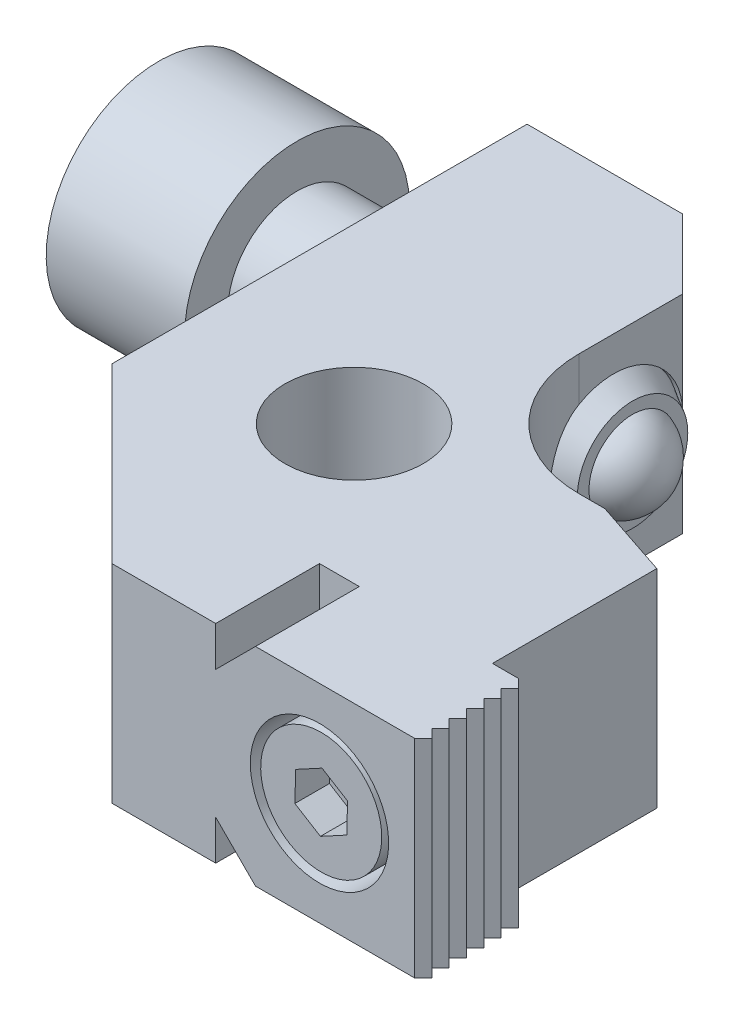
ISO-10303-21;
HEADER;
FILE_DESCRIPTION(('STEP AP214'),'2;1');
FILE_NAME('part.step','',(''),(''),'','','');
FILE_SCHEMA(('AUTOMOTIVE_DESIGN { 1 0 10303 214 1 1 1 1 }'));
ENDSEC;
DATA;
#1=APPLICATION_CONTEXT('core data for automotive mechanical design processes');
#2=APPLICATION_PROTOCOL_DEFINITION('international standard','automotive_design',2000,#1);
#3=PRODUCT_CONTEXT('',#1,'mechanical');
#4=PRODUCT('Part','Part','',(#3));
#5=PRODUCT_RELATED_PRODUCT_CATEGORY('part','',(#4));
#6=PRODUCT_DEFINITION_FORMATION('','',#4);
#7=PRODUCT_DEFINITION_CONTEXT('part definition',#1,'design');
#8=PRODUCT_DEFINITION('design','',#6,#7);
#9=PRODUCT_DEFINITION_SHAPE('','',#8);
#10=(LENGTH_UNIT() NAMED_UNIT(*) SI_UNIT(.MILLI.,.METRE.));
#11=(NAMED_UNIT(*) PLANE_ANGLE_UNIT() SI_UNIT($,.RADIAN.));
#12=(NAMED_UNIT(*) SI_UNIT($,.STERADIAN.) SOLID_ANGLE_UNIT());
#13=UNCERTAINTY_MEASURE_WITH_UNIT(LENGTH_MEASURE(1.E-05),#10,'distance_accuracy_value','');
#14=(GEOMETRIC_REPRESENTATION_CONTEXT(3) GLOBAL_UNCERTAINTY_ASSIGNED_CONTEXT((#13)) GLOBAL_UNIT_ASSIGNED_CONTEXT((#10,
#11,#12)) REPRESENTATION_CONTEXT('',''));
#15=CARTESIAN_POINT('',(0.,0.,0.));
#16=DIRECTION('',(0.,0.,1.));
#17=DIRECTION('',(1.,0.,0.));
#18=AXIS2_PLACEMENT_3D('',#15,#16,#17);
#19=CARTESIAN_POINT('',(12.,0.,8.));
#20=DIRECTION('',(0.,0.,1.));
#21=DIRECTION('',(1.,0.,0.));
#22=AXIS2_PLACEMENT_3D('',#19,#20,#21);
#23=CYLINDRICAL_SURFACE('',#22,2.);
#24=CARTESIAN_POINT('',(12.,0.,0.));
#25=DIRECTION('',(0.,0.,1.));
#26=DIRECTION('',(1.,0.,0.));
#27=AXIS2_PLACEMENT_3D('',#24,#25,#26);
#28=CIRCLE('',#27,2.);
#29=CARTESIAN_POINT('',(14.,0.,0.));
#30=VERTEX_POINT('',#29);
#31=EDGE_CURVE('E656',#30,#30,#28,.T.);
#32=ORIENTED_EDGE('',*,*,#31,.F.);
#33=EDGE_LOOP('',(#32));
#34=FACE_BOUND('',#33,.T.);
#35=CARTESIAN_POINT('',(12.,0.,3.90000000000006));
#36=DIRECTION('',(0.,0.,1.00000000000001));
#37=DIRECTION('',(0.999628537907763,-0.0272541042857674,0.));
#38=AXIS2_PLACEMENT_3D('',#35,#36,#37);
#39=CIRCLE('',#38,2.);
#40=CARTESIAN_POINT('',(13.9992570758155,-0.0545082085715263,3.90000000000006));
#41=VERTEX_POINT('',#40);
#42=EDGE_CURVE('E845',#41,#41,#39,.T.);
#43=ORIENTED_EDGE('',*,*,#42,.T.);
#44=EDGE_LOOP('',(#43));
#45=FACE_BOUND('',#44,.T.);
#46=ADVANCED_FACE('F15',(#34,#45),#23,.F.);
#47=CARTESIAN_POINT('',(12.,1.65,0.));
#48=DIRECTION('',(0.,0.,-1.));
#49=DIRECTION('',(-1.,0.,0.));
#50=AXIS2_PLACEMENT_3D('',#47,#48,#49);
#51=PLANE('',#50);
#52=CARTESIAN_POINT('',(12.,0.,0.));
#53=DIRECTION('',(0.,0.,1.));
#54=DIRECTION('',(1.,0.,0.));
#55=AXIS2_PLACEMENT_3D('',#52,#53,#54);
#56=CIRCLE('',#55,1.65);
#57=CARTESIAN_POINT('',(13.65,0.,0.));
#58=VERTEX_POINT('',#57);
#59=EDGE_CURVE('E653',#58,#58,#56,.T.);
#60=ORIENTED_EDGE('',*,*,#59,.F.);
#61=EDGE_LOOP('',(#60));
#62=FACE_BOUND('',#61,.T.);
#63=ORIENTED_EDGE('',*,*,#31,.T.);
#64=EDGE_LOOP('',(#63));
#65=FACE_BOUND('',#64,.T.);
#66=ADVANCED_FACE('F434',(#62,#65),#51,.F.);
#67=CARTESIAN_POINT('',(12.,0.,8.));
#68=DIRECTION('',(0.,0.,1.));
#69=DIRECTION('',(1.,0.,0.));
#70=AXIS2_PLACEMENT_3D('',#67,#68,#69);
#71=CYLINDRICAL_SURFACE('',#70,1.65);
#72=ORIENTED_EDGE('',*,*,#59,.T.);
#73=EDGE_LOOP('',(#72));
#74=FACE_BOUND('',#73,.T.);
#75=CARTESIAN_POINT('',(12.,0.,-2.83333333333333));
#76=DIRECTION('',(-0.316227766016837,0.,0.948683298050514));
#77=DIRECTION('',(0.948683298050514,0.,0.316227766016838));
#78=AXIS2_PLACEMENT_3D('',#75,#76,#77);
#79=ELLIPSE('',#78,1.7392527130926,1.65);
#80=CARTESIAN_POINT('',(11.5,-1.57241851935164,-3.));
#81=VERTEX_POINT('',#80);
#82=CARTESIAN_POINT('',(11.5,1.57241851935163,-3.));
#83=VERTEX_POINT('',#82);
#84=EDGE_CURVE('E305',#81,#83,#79,.T.);
#85=ORIENTED_EDGE('',*,*,#84,.F.);
#86=CARTESIAN_POINT('',(12.,0.,-3.));
#87=DIRECTION('',(0.,0.,1.));
#88=DIRECTION('',(1.,0.,0.));
#89=AXIS2_PLACEMENT_3D('',#86,#87,#88);
#90=CIRCLE('',#89,1.65);
#91=EDGE_CURVE('E659',#83,#81,#90,.T.);
#92=ORIENTED_EDGE('',*,*,#91,.F.);
#93=EDGE_LOOP('',(#85,#92));
#94=FACE_BOUND('',#93,.T.);
#95=ADVANCED_FACE('F944',(#74,#94),#71,.F.);
#96=CARTESIAN_POINT('',(16.,-6.,-1.5));
#97=DIRECTION('',(-0.316227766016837,0.,0.948683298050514));
#98=DIRECTION('',(0.948683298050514,0.,0.316227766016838));
#99=AXIS2_PLACEMENT_3D('',#96,#97,#98);
#100=PLANE('',#99);
#101=DIRECTION('',(0.,1.,0.));
#102=VECTOR('',#101,1.);
#103=CARTESIAN_POINT('',(11.5,-6.,-3.));
#104=LINE('',#103,#102);
#105=CARTESIAN_POINT('',(11.5,-6.,-3.));
#106=VERTEX_POINT('',#105);
#107=EDGE_CURVE('E671',#106,#81,#104,.T.);
#108=ORIENTED_EDGE('',*,*,#107,.T.);
#109=ORIENTED_EDGE('',*,*,#84,.T.);
#110=CARTESIAN_POINT('',(11.5,6.,-3.));
#111=VERTEX_POINT('',#110);
#112=EDGE_CURVE('E667',#83,#111,#104,.T.);
#113=ORIENTED_EDGE('',*,*,#112,.T.);
#114=DIRECTION('',(0.948683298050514,0.,0.316227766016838));
#115=VECTOR('',#114,1.);
#116=CARTESIAN_POINT('',(16.,6.,-1.5));
#117=LINE('',#116,#115);
#118=CARTESIAN_POINT('',(16.,6.,-1.5));
#119=VERTEX_POINT('',#118);
#120=EDGE_CURVE('E662',#111,#119,#117,.T.);
#121=ORIENTED_EDGE('',*,*,#120,.T.);
#122=DIRECTION('',(0.,1.,0.));
#123=VECTOR('',#122,1.);
#124=CARTESIAN_POINT('',(16.,-6.,-1.5));
#125=LINE('',#124,#123);
#126=CARTESIAN_POINT('',(16.,-6.,-1.5));
#127=VERTEX_POINT('',#126);
#128=EDGE_CURVE('E668',#127,#119,#125,.T.);
#129=ORIENTED_EDGE('',*,*,#128,.F.);
#130=DIRECTION('',(0.948683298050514,0.,0.316227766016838));
#131=VECTOR('',#130,1.);
#132=CARTESIAN_POINT('',(16.,-6.,-1.5));
#133=LINE('',#132,#131);
#134=EDGE_CURVE('E664',#106,#127,#133,.T.);
#135=ORIENTED_EDGE('',*,*,#134,.F.);
#136=EDGE_LOOP('',(#108,#109,#113,#121,#129,#135));
#137=FACE_BOUND('',#136,.T.);
#138=ADVANCED_FACE('F408',(#137),#100,.F.);
#139=CARTESIAN_POINT('',(10.,6.,-3.));
#140=DIRECTION('',(0.,0.,1.));
#141=DIRECTION('',(1.,0.,0.));
#142=AXIS2_PLACEMENT_3D('',#139,#140,#141);
#143=PLANE('',#142);
#144=ORIENTED_EDGE('',*,*,#112,.F.);
#145=ORIENTED_EDGE('',*,*,#91,.T.);
#146=ORIENTED_EDGE('',*,*,#107,.F.);
#147=DIRECTION('',(-1.,0.,0.));
#148=VECTOR('',#147,1.);
#149=CARTESIAN_POINT('',(10.,-6.,-3.));
#150=LINE('',#149,#148);
#151=CARTESIAN_POINT('',(10.,-6.,-3.));
#152=VERTEX_POINT('',#151);
#153=EDGE_CURVE('E368',#106,#152,#150,.T.);
#154=ORIENTED_EDGE('',*,*,#153,.T.);
#155=DIRECTION('',(0.,-1.,0.));
#156=VECTOR('',#155,1.);
#157=CARTESIAN_POINT('',(10.,6.,-3.));
#158=LINE('',#157,#156);
#159=CARTESIAN_POINT('',(10.,6.,-3.));
#160=VERTEX_POINT('',#159);
#161=EDGE_CURVE('E324',#160,#152,#158,.T.);
#162=ORIENTED_EDGE('',*,*,#161,.F.);
#163=DIRECTION('',(-1.,0.,0.));
#164=VECTOR('',#163,1.);
#165=CARTESIAN_POINT('',(10.,6.,-3.));
#166=LINE('',#165,#164);
#167=EDGE_CURVE('E344',#111,#160,#166,.T.);
#168=ORIENTED_EDGE('',*,*,#167,.F.);
#169=EDGE_LOOP('',(#144,#145,#146,#154,#162,#168));
#170=FACE_BOUND('',#169,.T.);
#171=ADVANCED_FACE('F438',(#170),#143,.F.);
#172=CARTESIAN_POINT('',(12.,0.,9.9));
#173=DIRECTION('',(0.,0.,1.));
#174=DIRECTION('',(-1.,0.,0.));
#175=AXIS2_PLACEMENT_3D('',#172,#173,#174);
#176=PLANE('',#175);
#177=CARTESIAN_POINT('',(12.,0.,9.90000000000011));
#178=DIRECTION('',(0.,0.,1.00000000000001));
#179=DIRECTION('',(0.999628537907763,-0.0272541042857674,0.));
#180=AXIS2_PLACEMENT_3D('',#177,#178,#179);
#181=CIRCLE('',#180,3.5);
#182=CARTESIAN_POINT('',(15.4986998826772,-0.0953893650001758,9.9000000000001));
#183=VERTEX_POINT('',#182);
#184=EDGE_CURVE('E1426',#183,#183,#181,.T.);
#185=ORIENTED_EDGE('',*,*,#184,.F.);
#186=EDGE_LOOP('',(#185));
#187=FACE_BOUND('',#186,.T.);
#188=CARTESIAN_POINT('',(12.,0.,9.9));
#189=DIRECTION('',(0.,0.,1.));
#190=DIRECTION('',(-1.,0.,0.));
#191=AXIS2_PLACEMENT_3D('',#188,#189,#190);
#192=CIRCLE('',#191,4.);
#193=CARTESIAN_POINT('',(8.,0.,9.90000000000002));
#194=VERTEX_POINT('',#193);
#195=EDGE_CURVE('E809',#194,#194,#192,.T.);
#196=ORIENTED_EDGE('',*,*,#195,.T.);
#197=EDGE_LOOP('',(#196));
#198=FACE_BOUND('',#197,.T.);
#199=ADVANCED_FACE('F547',(#187,#198),#176,.T.);
#200=CARTESIAN_POINT('',(12.,0.,9.9));
#201=DIRECTION('',(0.,0.,1.));
#202=DIRECTION('',(-1.,0.,0.));
#203=AXIS2_PLACEMENT_3D('',#200,#201,#202);
#204=CYLINDRICAL_SURFACE('',#203,4.);
#205=ORIENTED_EDGE('',*,*,#195,.F.);
#206=EDGE_LOOP('',(#205));
#207=FACE_BOUND('',#206,.T.);
#208=CARTESIAN_POINT('',(12.,0.,14.));
#209=DIRECTION('',(0.,0.,1.));
#210=DIRECTION('',(-1.,0.,0.));
#211=AXIS2_PLACEMENT_3D('',#208,#209,#210);
#212=CIRCLE('',#211,4.);
#213=CARTESIAN_POINT('',(8.,0.,14.));
#214=VERTEX_POINT('',#213);
#215=EDGE_CURVE('E805',#214,#214,#212,.T.);
#216=ORIENTED_EDGE('',*,*,#215,.T.);
#217=EDGE_LOOP('',(#216));
#218=FACE_BOUND('',#217,.T.);
#219=ADVANCED_FACE('F550',(#207,#218),#204,.F.);
#220=CARTESIAN_POINT('',(18.,6.,14.));
#221=DIRECTION('',(0.,0.,1.));
#222=DIRECTION('',(-1.,0.,0.));
#223=AXIS2_PLACEMENT_3D('',#220,#221,#222);
#224=PLANE('',#223);
#225=DIRECTION('',(0.,1.,0.));
#226=VECTOR('',#225,1.);
#227=CARTESIAN_POINT('',(17.5,-6.,14.));
#228=LINE('',#227,#226);
#229=CARTESIAN_POINT('',(17.5,-6.,14.));
#230=VERTEX_POINT('',#229);
#231=CARTESIAN_POINT('',(17.5,6.,14.));
#232=VERTEX_POINT('',#231);
#233=EDGE_CURVE('E802',#230,#232,#228,.T.);
#234=ORIENTED_EDGE('',*,*,#233,.T.);
#235=DIRECTION('',(-1.,0.,0.));
#236=VECTOR('',#235,1.);
#237=CARTESIAN_POINT('',(18.,6.,14.));
#238=LINE('',#237,#236);
#239=CARTESIAN_POINT('',(8.3,6.,14.));
#240=VERTEX_POINT('',#239);
#241=EDGE_CURVE('E722',#232,#240,#238,.T.);
#242=ORIENTED_EDGE('',*,*,#241,.T.);
#243=DIRECTION('',(-0.707106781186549,-0.707106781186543,0.));
#244=VECTOR('',#243,1.);
#245=CARTESIAN_POINT('',(6.,3.7,14.));
#246=LINE('',#245,#244);
#247=CARTESIAN_POINT('',(6.,3.7,14.));
#248=VERTEX_POINT('',#247);
#249=EDGE_CURVE('E718',#240,#248,#246,.T.);
#250=ORIENTED_EDGE('',*,*,#249,.T.);
#251=DIRECTION('',(0.,-1.,0.));
#252=VECTOR('',#251,1.);
#253=CARTESIAN_POINT('',(6.,6.,14.));
#254=LINE('',#253,#252);
#255=CARTESIAN_POINT('',(6.,6.,14.));
#256=VERTEX_POINT('',#255);
#257=EDGE_CURVE('E333',#256,#248,#254,.T.);
#258=ORIENTED_EDGE('',*,*,#257,.F.);
#259=DIRECTION('',(1.,0.,0.));
#260=VECTOR('',#259,1.);
#261=CARTESIAN_POINT('',(6.,6.,14.));
#262=LINE('',#261,#260);
#263=CARTESIAN_POINT('',(0.,6.,14.));
#264=VERTEX_POINT('',#263);
#265=EDGE_CURVE('E337',#264,#256,#262,.T.);
#266=ORIENTED_EDGE('',*,*,#265,.F.);
#267=DIRECTION('',(0.,-1.,0.));
#268=VECTOR('',#267,1.);
#269=CARTESIAN_POINT('',(0.,6.,14.));
#270=LINE('',#269,#268);
#271=CARTESIAN_POINT('',(0.,-6.,14.));
#272=VERTEX_POINT('',#271);
#273=EDGE_CURVE('E314',#264,#272,#270,.T.);
#274=ORIENTED_EDGE('',*,*,#273,.T.);
#275=DIRECTION('',(1.,0.,0.));
#276=VECTOR('',#275,1.);
#277=CARTESIAN_POINT('',(6.,-6.,14.));
#278=LINE('',#277,#276);
#279=CARTESIAN_POINT('',(6.,-6.,14.));
#280=VERTEX_POINT('',#279);
#281=EDGE_CURVE('E355',#272,#280,#278,.T.);
#282=ORIENTED_EDGE('',*,*,#281,.T.);
#283=CARTESIAN_POINT('',(6.,-3.7,14.));
#284=VERTEX_POINT('',#283);
#285=EDGE_CURVE('E336',#284,#280,#254,.T.);
#286=ORIENTED_EDGE('',*,*,#285,.F.);
#287=DIRECTION('',(0.707106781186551,-0.707106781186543,0.));
#288=VECTOR('',#287,1.);
#289=CARTESIAN_POINT('',(8.3,-6.,14.));
#290=LINE('',#289,#288);
#291=CARTESIAN_POINT('',(8.3,-6.,14.));
#292=VERTEX_POINT('',#291);
#293=EDGE_CURVE('E712',#284,#292,#290,.T.);
#294=ORIENTED_EDGE('',*,*,#293,.T.);
#295=DIRECTION('',(1.,0.,0.));
#296=VECTOR('',#295,1.);
#297=CARTESIAN_POINT('',(18.,-6.,14.));
#298=LINE('',#297,#296);
#299=EDGE_CURVE('E717',#292,#230,#298,.T.);
#300=ORIENTED_EDGE('',*,*,#299,.T.);
#301=EDGE_LOOP('',(#234,#242,#250,#258,#266,#274,#282,#286,#294,#300));
#302=FACE_BOUND('',#301,.T.);
#303=ORIENTED_EDGE('',*,*,#215,.F.);
#304=EDGE_LOOP('',(#303));
#305=FACE_BOUND('',#304,.T.);
#306=ADVANCED_FACE('F499',(#302,#305),#224,.T.);
#307=CARTESIAN_POINT('',(17.5,-6.,14.));
#308=DIRECTION('',(-0.707106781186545,0.,-0.707106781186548));
#309=DIRECTION('',(0.707106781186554,0.,-0.707106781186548));
#310=AXIS2_PLACEMENT_3D('',#307,#308,#309);
#311=PLANE('',#310);
#312=DIRECTION('',(-0.707106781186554,0.,0.707106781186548));
#313=VECTOR('',#312,1.);
#314=CARTESIAN_POINT('',(17.5,6.,14.));
#315=LINE('',#314,#313);
#316=CARTESIAN_POINT('',(18.,6.,13.5));
#317=VERTEX_POINT('',#316);
#318=EDGE_CURVE('E884',#317,#232,#315,.T.);
#319=ORIENTED_EDGE('',*,*,#318,.T.);
#320=ORIENTED_EDGE('',*,*,#233,.F.);
#321=DIRECTION('',(-0.707106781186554,0.,0.707106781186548));
#322=VECTOR('',#321,1.);
#323=CARTESIAN_POINT('',(17.5,-6.,14.));
#324=LINE('',#323,#322);
#325=CARTESIAN_POINT('',(18.,-6.,13.5));
#326=VERTEX_POINT('',#325);
#327=EDGE_CURVE('E814',#326,#230,#324,.T.);
#328=ORIENTED_EDGE('',*,*,#327,.F.);
#329=DIRECTION('',(0.,1.,0.));
#330=VECTOR('',#329,1.);
#331=CARTESIAN_POINT('',(18.,-6.,13.5));
#332=LINE('',#331,#330);
#333=EDGE_CURVE('E806',#326,#317,#332,.T.);
#334=ORIENTED_EDGE('',*,*,#333,.T.);
#335=EDGE_LOOP('',(#319,#320,#328,#334));
#336=FACE_BOUND('',#335,.T.);
#337=ADVANCED_FACE('F496',(#336),#311,.F.);
#338=CARTESIAN_POINT('',(18.,6.,14.));
#339=DIRECTION('',(0.,-1.,0.));
#340=DIRECTION('',(0.,0.,1.));
#341=AXIS2_PLACEMENT_3D('',#338,#339,#340);
#342=PLANE('',#341);
#343=ORIENTED_EDGE('',*,*,#241,.F.);
#344=ORIENTED_EDGE('',*,*,#318,.F.);
#345=DIRECTION('',(0.707106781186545,0.,0.707106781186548));
#346=VECTOR('',#345,1.);
#347=CARTESIAN_POINT('',(18.,6.,13.5));
#348=LINE('',#347,#346);
#349=CARTESIAN_POINT('',(17.5,6.,13.));
#350=VERTEX_POINT('',#349);
#351=EDGE_CURVE('E881',#350,#317,#348,.T.);
#352=ORIENTED_EDGE('',*,*,#351,.F.);
#353=DIRECTION('',(-0.707106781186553,0.,0.707106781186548));
#354=VECTOR('',#353,1.);
#355=CARTESIAN_POINT('',(17.5,6.,13.));
#356=LINE('',#355,#354);
#357=CARTESIAN_POINT('',(18.,6.,12.5));
#358=VERTEX_POINT('',#357);
#359=EDGE_CURVE('E878',#358,#350,#356,.T.);
#360=ORIENTED_EDGE('',*,*,#359,.F.);
#361=DIRECTION('',(0.707106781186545,0.,0.707106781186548));
#362=VECTOR('',#361,1.);
#363=CARTESIAN_POINT('',(18.,6.,12.5));
#364=LINE('',#363,#362);
#365=CARTESIAN_POINT('',(17.5,6.,12.));
#366=VERTEX_POINT('',#365);
#367=EDGE_CURVE('E875',#366,#358,#364,.T.);
#368=ORIENTED_EDGE('',*,*,#367,.F.);
#369=DIRECTION('',(-0.707106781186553,0.,0.707106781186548));
#370=VECTOR('',#369,1.);
#371=CARTESIAN_POINT('',(17.5,6.,12.));
#372=LINE('',#371,#370);
#373=CARTESIAN_POINT('',(18.,6.,11.5));
#374=VERTEX_POINT('',#373);
#375=EDGE_CURVE('E872',#374,#366,#372,.T.);
#376=ORIENTED_EDGE('',*,*,#375,.F.);
#377=DIRECTION('',(0.707106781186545,0.,0.707106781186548));
#378=VECTOR('',#377,1.);
#379=CARTESIAN_POINT('',(18.,6.,11.5));
#380=LINE('',#379,#378);
#381=CARTESIAN_POINT('',(17.5,6.,11.));
#382=VERTEX_POINT('',#381);
#383=EDGE_CURVE('E869',#382,#374,#380,.T.);
#384=ORIENTED_EDGE('',*,*,#383,.F.);
#385=DIRECTION('',(-0.707106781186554,0.,0.707106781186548));
#386=VECTOR('',#385,1.);
#387=CARTESIAN_POINT('',(17.5,6.,11.));
#388=LINE('',#387,#386);
#389=CARTESIAN_POINT('',(18.,6.,10.5));
#390=VERTEX_POINT('',#389);
#391=EDGE_CURVE('E866',#390,#382,#388,.T.);
#392=ORIENTED_EDGE('',*,*,#391,.F.);
#393=DIRECTION('',(0.707106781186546,0.,0.707106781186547));
#394=VECTOR('',#393,1.);
#395=CARTESIAN_POINT('',(18.,6.,10.5));
#396=LINE('',#395,#394);
#397=CARTESIAN_POINT('',(17.5,6.,10.));
#398=VERTEX_POINT('',#397);
#399=EDGE_CURVE('E863',#398,#390,#396,.T.);
#400=ORIENTED_EDGE('',*,*,#399,.F.);
#401=DIRECTION('',(-0.707106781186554,0.,0.707106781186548));
#402=VECTOR('',#401,1.);
#403=CARTESIAN_POINT('',(17.5,6.,10.));
#404=LINE('',#403,#402);
#405=CARTESIAN_POINT('',(18.,6.,9.5));
#406=VERTEX_POINT('',#405);
#407=EDGE_CURVE('E860',#406,#398,#404,.T.);
#408=ORIENTED_EDGE('',*,*,#407,.F.);
#409=DIRECTION('',(0.707106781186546,0.,0.707106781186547));
#410=VECTOR('',#409,1.);
#411=CARTESIAN_POINT('',(18.,6.,9.5));
#412=LINE('',#411,#410);
#413=CARTESIAN_POINT('',(17.5,6.,9.));
#414=VERTEX_POINT('',#413);
#415=EDGE_CURVE('E857',#414,#406,#412,.T.);
#416=ORIENTED_EDGE('',*,*,#415,.F.);
#417=DIRECTION('',(-0.707106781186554,0.,0.707106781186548));
#418=VECTOR('',#417,1.);
#419=CARTESIAN_POINT('',(17.5,6.,9.));
#420=LINE('',#419,#418);
#421=CARTESIAN_POINT('',(18.,6.,8.5));
#422=VERTEX_POINT('',#421);
#423=EDGE_CURVE('E854',#422,#414,#420,.T.);
#424=ORIENTED_EDGE('',*,*,#423,.F.);
#425=DIRECTION('',(0.707106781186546,0.,0.707106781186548));
#426=VECTOR('',#425,1.);
#427=CARTESIAN_POINT('',(18.,6.,8.5));
#428=LINE('',#427,#426);
#429=CARTESIAN_POINT('',(17.5,6.,8.));
#430=VERTEX_POINT('',#429);
#431=EDGE_CURVE('E646',#430,#422,#428,.T.);
#432=ORIENTED_EDGE('',*,*,#431,.F.);
#433=DIRECTION('',(-1.,0.,0.));
#434=VECTOR('',#433,1.);
#435=CARTESIAN_POINT('',(18.,6.,8.));
#436=LINE('',#435,#434);
#437=CARTESIAN_POINT('',(16.,6.,8.));
#438=VERTEX_POINT('',#437);
#439=EDGE_CURVE('E794',#430,#438,#436,.T.);
#440=ORIENTED_EDGE('',*,*,#439,.T.);
#441=DIRECTION('',(0.,0.,-1.));
#442=VECTOR('',#441,1.);
#443=CARTESIAN_POINT('',(16.,6.,-3.));
#444=LINE('',#443,#442);
#445=EDGE_CURVE('E346',#438,#119,#444,.T.);
#446=ORIENTED_EDGE('',*,*,#445,.T.);
#447=ORIENTED_EDGE('',*,*,#120,.F.);
#448=ORIENTED_EDGE('',*,*,#167,.T.);
#449=CARTESIAN_POINT('',(10.,6.,-10.));
#450=DIRECTION('',(0.,-1.,0.));
#451=DIRECTION('',(-1.,0.,0.));
#452=AXIS2_PLACEMENT_3D('',#449,#450,#451);
#453=CIRCLE('',#452,7.);
#454=CARTESIAN_POINT('',(3.,6.,-10.));
#455=VERTEX_POINT('',#454);
#456=EDGE_CURVE('E291',#160,#455,#453,.T.);
#457=ORIENTED_EDGE('',*,*,#456,.T.);
#458=DIRECTION('',(0.,0.,-1.));
#459=VECTOR('',#458,1.);
#460=CARTESIAN_POINT('',(3.,6.,-20.));
#461=LINE('',#460,#459);
#462=CARTESIAN_POINT('',(3.,6.,-16.));
#463=VERTEX_POINT('',#462);
#464=EDGE_CURVE('E279',#455,#463,#461,.T.);
#465=ORIENTED_EDGE('',*,*,#464,.T.);
#466=DIRECTION('',(0.707106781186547,0.,0.707106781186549));
#467=VECTOR('',#466,1.);
#468=CARTESIAN_POINT('',(9.5,6.,-9.5));
#469=LINE('',#468,#467);
#470=CARTESIAN_POINT('',(-1.,6.,-20.));
#471=VERTEX_POINT('',#470);
#472=EDGE_CURVE('E19',#463,#471,#469,.F.);
#473=ORIENTED_EDGE('',*,*,#472,.T.);
#474=DIRECTION('',(-1.,0.,0.));
#475=VECTOR('',#474,1.);
#476=CARTESIAN_POINT('',(-10.,6.,-20.));
#477=LINE('',#476,#475);
#478=CARTESIAN_POINT('',(-10.,6.,-20.));
#479=VERTEX_POINT('',#478);
#480=EDGE_CURVE('E293',#471,#479,#477,.T.);
#481=ORIENTED_EDGE('',*,*,#480,.T.);
#482=DIRECTION('',(0.,0.,1.));
#483=VECTOR('',#482,1.);
#484=CARTESIAN_POINT('',(-10.,6.,14.));
#485=LINE('',#484,#483);
#486=CARTESIAN_POINT('',(-10.,6.,4.));
#487=VERTEX_POINT('',#486);
#488=EDGE_CURVE('E339',#479,#487,#485,.T.);
#489=ORIENTED_EDGE('',*,*,#488,.T.);
#490=DIRECTION('',(-0.707106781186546,0.,-0.707106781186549));
#491=VECTOR('',#490,1.);
#492=CARTESIAN_POINT('',(-7.,6.,7.));
#493=LINE('',#492,#491);
#494=EDGE_CURVE('E308',#487,#264,#493,.F.);
#495=ORIENTED_EDGE('',*,*,#494,.T.);
#496=ORIENTED_EDGE('',*,*,#265,.T.);
#497=DIRECTION('',(0.,0.,-1.));
#498=VECTOR('',#497,1.);
#499=CARTESIAN_POINT('',(6.,6.,14.));
#500=LINE('',#499,#498);
#501=CARTESIAN_POINT('',(6.,6.,8.));
#502=VERTEX_POINT('',#501);
#503=EDGE_CURVE('E352',#256,#502,#500,.T.);
#504=ORIENTED_EDGE('',*,*,#503,.T.);
#505=DIRECTION('',(1.,0.,0.));
#506=VECTOR('',#505,1.);
#507=CARTESIAN_POINT('',(6.,6.,8.));
#508=LINE('',#507,#506);
#509=CARTESIAN_POINT('',(8.3,6.,8.));
#510=VERTEX_POINT('',#509);
#511=EDGE_CURVE('E349',#502,#510,#508,.T.);
#512=ORIENTED_EDGE('',*,*,#511,.T.);
#513=DIRECTION('',(0.,0.,-1.));
#514=VECTOR('',#513,1.);
#515=CARTESIAN_POINT('',(8.3,6.,14.));
#516=LINE('',#515,#514);
#517=EDGE_CURVE('E323',#240,#510,#516,.T.);
#518=ORIENTED_EDGE('',*,*,#517,.F.);
#519=EDGE_LOOP('',(#343,#344,#352,#360,#368,#376,#384,#392,#400,#408,#416,#424,#432,#440,#446,
#447,#448,#457,#465,#473,#481,#489,#495,#496,#504,#512,#518));
#520=FACE_BOUND('',#519,.T.);
#521=CARTESIAN_POINT('',(0.,6.,0.));
#522=DIRECTION('',(0.,1.,0.));
#523=DIRECTION('',(-1.,0.,0.));
#524=AXIS2_PLACEMENT_3D('',#521,#522,#523);
#525=CIRCLE('',#524,4.);
#526=CARTESIAN_POINT('',(-4.,6.,0.));
#527=VERTEX_POINT('',#526);
#528=EDGE_CURVE('E379',#527,#527,#525,.T.);
#529=ORIENTED_EDGE('',*,*,#528,.F.);
#530=EDGE_LOOP('',(#529));
#531=FACE_BOUND('',#530,.T.);
#532=ADVANCED_FACE('F287',(#520,#531),#342,.F.);
#533=CARTESIAN_POINT('',(6.,3.7,14.));
#534=DIRECTION('',(0.707106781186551,-0.707106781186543,0.));
#535=DIRECTION('',(0.707106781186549,0.707106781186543,0.));
#536=AXIS2_PLACEMENT_3D('',#533,#534,#535);
#537=PLANE('',#536);
#538=DIRECTION('',(-0.707106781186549,-0.707106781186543,0.));
#539=VECTOR('',#538,1.);
#540=CARTESIAN_POINT('',(6.,3.7,8.));
#541=LINE('',#540,#539);
#542=CARTESIAN_POINT('',(6.,3.7,8.));
#543=VERTEX_POINT('',#542);
#544=EDGE_CURVE('E788',#510,#543,#541,.T.);
#545=ORIENTED_EDGE('',*,*,#544,.T.);
#546=DIRECTION('',(0.,0.,-1.));
#547=VECTOR('',#546,1.);
#548=CARTESIAN_POINT('',(6.,3.7,14.));
#549=LINE('',#548,#547);
#550=EDGE_CURVE('E728',#248,#543,#549,.T.);
#551=ORIENTED_EDGE('',*,*,#550,.F.);
#552=ORIENTED_EDGE('',*,*,#249,.F.);
#553=ORIENTED_EDGE('',*,*,#517,.T.);
#554=EDGE_LOOP('',(#545,#551,#552,#553));
#555=FACE_BOUND('',#554,.T.);
#556=ADVANCED_FACE('F555',(#555),#537,.F.);
#557=CARTESIAN_POINT('',(8.3,-6.,14.));
#558=DIRECTION('',(0.707106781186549,0.707106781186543,0.));
#559=DIRECTION('',(-0.707106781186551,0.707106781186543,0.));
#560=AXIS2_PLACEMENT_3D('',#557,#558,#559);
#561=PLANE('',#560);
#562=DIRECTION('',(0.707106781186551,-0.707106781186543,0.));
#563=VECTOR('',#562,1.);
#564=CARTESIAN_POINT('',(8.3,-6.,8.));
#565=LINE('',#564,#563);
#566=CARTESIAN_POINT('',(6.,-3.7,8.));
#567=VERTEX_POINT('',#566);
#568=CARTESIAN_POINT('',(8.3,-6.,8.));
#569=VERTEX_POINT('',#568);
#570=EDGE_CURVE('E793',#567,#569,#565,.T.);
#571=ORIENTED_EDGE('',*,*,#570,.T.);
#572=DIRECTION('',(0.,0.,-1.));
#573=VECTOR('',#572,1.);
#574=CARTESIAN_POINT('',(8.3,-6.,14.));
#575=LINE('',#574,#573);
#576=EDGE_CURVE('E715',#292,#569,#575,.T.);
#577=ORIENTED_EDGE('',*,*,#576,.F.);
#578=ORIENTED_EDGE('',*,*,#293,.F.);
#579=DIRECTION('',(0.,0.,-1.));
#580=VECTOR('',#579,1.);
#581=CARTESIAN_POINT('',(6.,-3.7,14.));
#582=LINE('',#581,#580);
#583=EDGE_CURVE('E709',#284,#567,#582,.T.);
#584=ORIENTED_EDGE('',*,*,#583,.T.);
#585=EDGE_LOOP('',(#571,#577,#578,#584));
#586=FACE_BOUND('',#585,.T.);
#587=ADVANCED_FACE('F564',(#586),#561,.F.);
#588=CARTESIAN_POINT('',(18.,-6.,14.));
#589=DIRECTION('',(0.,1.,0.));
#590=DIRECTION('',(0.,0.,-1.));
#591=AXIS2_PLACEMENT_3D('',#588,#589,#590);
#592=PLANE('',#591);
#593=DIRECTION('',(0.707106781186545,0.,0.707106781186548));
#594=VECTOR('',#593,1.);
#595=CARTESIAN_POINT('',(18.,-6.,13.5));
#596=LINE('',#595,#594);
#597=CARTESIAN_POINT('',(17.5,-6.,13.));
#598=VERTEX_POINT('',#597);
#599=EDGE_CURVE('E915',#598,#326,#596,.T.);
#600=ORIENTED_EDGE('',*,*,#599,.T.);
#601=ORIENTED_EDGE('',*,*,#327,.T.);
#602=ORIENTED_EDGE('',*,*,#299,.F.);
#603=ORIENTED_EDGE('',*,*,#576,.T.);
#604=DIRECTION('',(1.,0.,0.));
#605=VECTOR('',#604,1.);
#606=CARTESIAN_POINT('',(6.,-6.,8.));
#607=LINE('',#606,#605);
#608=CARTESIAN_POINT('',(6.,-6.,8.));
#609=VERTEX_POINT('',#608);
#610=EDGE_CURVE('E373',#609,#569,#607,.T.);
#611=ORIENTED_EDGE('',*,*,#610,.F.);
#612=DIRECTION('',(0.,0.,-1.));
#613=VECTOR('',#612,1.);
#614=CARTESIAN_POINT('',(6.,-6.,14.));
#615=LINE('',#614,#613);
#616=EDGE_CURVE('E376',#280,#609,#615,.T.);
#617=ORIENTED_EDGE('',*,*,#616,.F.);
#618=ORIENTED_EDGE('',*,*,#281,.F.);
#619=DIRECTION('',(0.707106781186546,0.,0.707106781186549));
#620=VECTOR('',#619,1.);
#621=CARTESIAN_POINT('',(0.,-6.,14.));
#622=LINE('',#621,#620);
#623=CARTESIAN_POINT('',(-10.,-6.,4.));
#624=VERTEX_POINT('',#623);
#625=EDGE_CURVE('E312',#272,#624,#622,.F.);
#626=ORIENTED_EDGE('',*,*,#625,.T.);
#627=DIRECTION('',(0.,0.,1.));
#628=VECTOR('',#627,1.);
#629=CARTESIAN_POINT('',(-10.,-6.,14.));
#630=LINE('',#629,#628);
#631=CARTESIAN_POINT('',(-10.,-6.,-20.));
#632=VERTEX_POINT('',#631);
#633=EDGE_CURVE('E358',#632,#624,#630,.T.);
#634=ORIENTED_EDGE('',*,*,#633,.F.);
#635=DIRECTION('',(-1.,0.,0.));
#636=VECTOR('',#635,1.);
#637=CARTESIAN_POINT('',(-10.,-6.,-20.));
#638=LINE('',#637,#636);
#639=CARTESIAN_POINT('',(-1.,-6.,-20.));
#640=VERTEX_POINT('',#639);
#641=EDGE_CURVE('E361',#640,#632,#638,.T.);
#642=ORIENTED_EDGE('',*,*,#641,.F.);
#643=DIRECTION('',(-0.707106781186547,0.,-0.707106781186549));
#644=VECTOR('',#643,1.);
#645=CARTESIAN_POINT('',(-1.,-6.,-20.));
#646=LINE('',#645,#644);
#647=CARTESIAN_POINT('',(3.,-6.,-16.));
#648=VERTEX_POINT('',#647);
#649=EDGE_CURVE('E283',#640,#648,#646,.F.);
#650=ORIENTED_EDGE('',*,*,#649,.T.);
#651=DIRECTION('',(0.,0.,-1.));
#652=VECTOR('',#651,1.);
#653=CARTESIAN_POINT('',(3.,-6.,-20.));
#654=LINE('',#653,#652);
#655=CARTESIAN_POINT('',(3.,-6.,-10.));
#656=VERTEX_POINT('',#655);
#657=EDGE_CURVE('E363',#656,#648,#654,.T.);
#658=ORIENTED_EDGE('',*,*,#657,.F.);
#659=CARTESIAN_POINT('',(10.,-6.,-10.));
#660=DIRECTION('',(0.,-1.,0.));
#661=DIRECTION('',(-1.,0.,0.));
#662=AXIS2_PLACEMENT_3D('',#659,#660,#661);
#663=CIRCLE('',#662,7.);
#664=EDGE_CURVE('E365',#152,#656,#663,.T.);
#665=ORIENTED_EDGE('',*,*,#664,.F.);
#666=ORIENTED_EDGE('',*,*,#153,.F.);
#667=ORIENTED_EDGE('',*,*,#134,.T.);
#668=DIRECTION('',(0.,0.,-1.));
#669=VECTOR('',#668,1.);
#670=CARTESIAN_POINT('',(16.,-6.,-3.));
#671=LINE('',#670,#669);
#672=CARTESIAN_POINT('',(16.,-6.,7.9999999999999));
#673=VERTEX_POINT('',#672);
#674=EDGE_CURVE('E370',#673,#127,#671,.T.);
#675=ORIENTED_EDGE('',*,*,#674,.F.);
#676=DIRECTION('',(1.,0.,0.));
#677=VECTOR('',#676,1.);
#678=CARTESIAN_POINT('',(18.,-6.,7.99999999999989));
#679=LINE('',#678,#677);
#680=CARTESIAN_POINT('',(17.5,-6.,7.99999999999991));
#681=VERTEX_POINT('',#680);
#682=EDGE_CURVE('E796',#673,#681,#679,.T.);
#683=ORIENTED_EDGE('',*,*,#682,.T.);
#684=DIRECTION('',(0.707106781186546,0.,0.707106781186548));
#685=VECTOR('',#684,1.);
#686=CARTESIAN_POINT('',(18.,-6.,8.49999999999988));
#687=LINE('',#686,#685);
#688=CARTESIAN_POINT('',(18.,-6.,8.49999999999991));
#689=VERTEX_POINT('',#688);
#690=EDGE_CURVE('E886',#681,#689,#687,.T.);
#691=ORIENTED_EDGE('',*,*,#690,.T.);
#692=DIRECTION('',(-0.707106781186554,0.,0.707106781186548));
#693=VECTOR('',#692,1.);
#694=CARTESIAN_POINT('',(17.5,-6.,9.));
#695=LINE('',#694,#693);
#696=CARTESIAN_POINT('',(17.5,-6.,9.));
#697=VERTEX_POINT('',#696);
#698=EDGE_CURVE('E889',#689,#697,#695,.T.);
#699=ORIENTED_EDGE('',*,*,#698,.T.);
#700=DIRECTION('',(0.707106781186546,0.,0.707106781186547));
#701=VECTOR('',#700,1.);
#702=CARTESIAN_POINT('',(18.,-6.,9.5));
#703=LINE('',#702,#701);
#704=CARTESIAN_POINT('',(18.,-6.,9.5));
#705=VERTEX_POINT('',#704);
#706=EDGE_CURVE('E892',#697,#705,#703,.T.);
#707=ORIENTED_EDGE('',*,*,#706,.T.);
#708=DIRECTION('',(-0.707106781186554,0.,0.707106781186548));
#709=VECTOR('',#708,1.);
#710=CARTESIAN_POINT('',(17.5,-6.,9.99999999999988));
#711=LINE('',#710,#709);
#712=CARTESIAN_POINT('',(17.5,-6.,9.99999999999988));
#713=VERTEX_POINT('',#712);
#714=EDGE_CURVE('E895',#705,#713,#711,.T.);
#715=ORIENTED_EDGE('',*,*,#714,.T.);
#716=DIRECTION('',(0.707106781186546,0.,0.707106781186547));
#717=VECTOR('',#716,1.);
#718=CARTESIAN_POINT('',(18.,-6.,10.5));
#719=LINE('',#718,#717);
#720=CARTESIAN_POINT('',(18.,-6.,10.5));
#721=VERTEX_POINT('',#720);
#722=EDGE_CURVE('E898',#713,#721,#719,.T.);
#723=ORIENTED_EDGE('',*,*,#722,.T.);
#724=DIRECTION('',(-0.707106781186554,0.,0.707106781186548));
#725=VECTOR('',#724,1.);
#726=CARTESIAN_POINT('',(17.5,-6.,11.));
#727=LINE('',#726,#725);
#728=CARTESIAN_POINT('',(17.5,-6.,11.));
#729=VERTEX_POINT('',#728);
#730=EDGE_CURVE('E901',#721,#729,#727,.T.);
#731=ORIENTED_EDGE('',*,*,#730,.T.);
#732=DIRECTION('',(0.707106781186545,0.,0.707106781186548));
#733=VECTOR('',#732,1.);
#734=CARTESIAN_POINT('',(18.,-6.,11.5));
#735=LINE('',#734,#733);
#736=CARTESIAN_POINT('',(18.,-6.,11.5));
#737=VERTEX_POINT('',#736);
#738=EDGE_CURVE('E904',#729,#737,#735,.T.);
#739=ORIENTED_EDGE('',*,*,#738,.T.);
#740=DIRECTION('',(-0.707106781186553,0.,0.707106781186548));
#741=VECTOR('',#740,1.);
#742=CARTESIAN_POINT('',(17.5,-6.,11.9999999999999));
#743=LINE('',#742,#741);
#744=CARTESIAN_POINT('',(17.5,-6.,11.9999999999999));
#745=VERTEX_POINT('',#744);
#746=EDGE_CURVE('E907',#737,#745,#743,.T.);
#747=ORIENTED_EDGE('',*,*,#746,.T.);
#748=DIRECTION('',(0.707106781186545,0.,0.707106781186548));
#749=VECTOR('',#748,1.);
#750=CARTESIAN_POINT('',(18.,-6.,12.4999999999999));
#751=LINE('',#750,#749);
#752=CARTESIAN_POINT('',(18.,-6.,12.4999999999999));
#753=VERTEX_POINT('',#752);
#754=EDGE_CURVE('E910',#745,#753,#751,.T.);
#755=ORIENTED_EDGE('',*,*,#754,.T.);
#756=DIRECTION('',(-0.707106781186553,0.,0.707106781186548));
#757=VECTOR('',#756,1.);
#758=CARTESIAN_POINT('',(17.5,-6.,13.));
#759=LINE('',#758,#757);
#760=EDGE_CURVE('E913',#753,#598,#759,.T.);
#761=ORIENTED_EDGE('',*,*,#760,.T.);
#762=EDGE_LOOP('',(#600,#601,#602,#603,#611,#617,#618,#626,#634,#642,#650,#658,#665,#666,#667,
#675,#683,#691,#699,#707,#715,#723,#731,#739,#747,#755,#761));
#763=FACE_BOUND('',#762,.T.);
#764=CARTESIAN_POINT('',(0.,-6.,0.));
#765=DIRECTION('',(0.,1.,0.));
#766=DIRECTION('',(-1.,0.,0.));
#767=AXIS2_PLACEMENT_3D('',#764,#765,#766);
#768=CIRCLE('',#767,4.);
#769=CARTESIAN_POINT('',(-4.,-6.,0.));
#770=VERTEX_POINT('',#769);
#771=EDGE_CURVE('E382',#770,#770,#768,.T.);
#772=ORIENTED_EDGE('',*,*,#771,.T.);
#773=EDGE_LOOP('',(#772));
#774=FACE_BOUND('',#773,.T.);
#775=ADVANCED_FACE('F505',(#763,#774),#592,.F.);
#776=CARTESIAN_POINT('',(18.,-6.,13.5));
#777=DIRECTION('',(-0.707106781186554,0.,0.707106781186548));
#778=DIRECTION('',(-0.707106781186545,0.,-0.707106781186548));
#779=AXIS2_PLACEMENT_3D('',#776,#777,#778);
#780=PLANE('',#779);
#781=ORIENTED_EDGE('',*,*,#351,.T.);
#782=ORIENTED_EDGE('',*,*,#333,.F.);
#783=ORIENTED_EDGE('',*,*,#599,.F.);
#784=DIRECTION('',(0.,1.,0.));
#785=VECTOR('',#784,1.);
#786=CARTESIAN_POINT('',(17.5,-6.,13.));
#787=LINE('',#786,#785);
#788=EDGE_CURVE('E811',#598,#350,#787,.T.);
#789=ORIENTED_EDGE('',*,*,#788,.T.);
#790=EDGE_LOOP('',(#781,#782,#783,#789));
#791=FACE_BOUND('',#790,.T.);
#792=ADVANCED_FACE('F501',(#791),#780,.F.);
#793=CARTESIAN_POINT('',(17.5,-6.,13.));
#794=DIRECTION('',(-0.707106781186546,0.,-0.707106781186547));
#795=DIRECTION('',(0.707106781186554,0.,-0.707106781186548));
#796=AXIS2_PLACEMENT_3D('',#793,#794,#795);
#797=PLANE('',#796);
#798=ORIENTED_EDGE('',*,*,#359,.T.);
#799=ORIENTED_EDGE('',*,*,#788,.F.);
#800=ORIENTED_EDGE('',*,*,#760,.F.);
#801=DIRECTION('',(0.,1.,0.));
#802=VECTOR('',#801,1.);
#803=CARTESIAN_POINT('',(18.,-6.,12.4999999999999));
#804=LINE('',#803,#802);
#805=EDGE_CURVE('E818',#753,#358,#804,.T.);
#806=ORIENTED_EDGE('',*,*,#805,.T.);
#807=EDGE_LOOP('',(#798,#799,#800,#806));
#808=FACE_BOUND('',#807,.T.);
#809=ADVANCED_FACE('F504',(#808),#797,.F.);
#810=CARTESIAN_POINT('',(18.,-6.,12.4999999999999));
#811=DIRECTION('',(-0.707106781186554,0.,0.707106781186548));
#812=DIRECTION('',(-0.707106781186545,0.,-0.707106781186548));
#813=AXIS2_PLACEMENT_3D('',#810,#811,#812);
#814=PLANE('',#813);
#815=ORIENTED_EDGE('',*,*,#367,.T.);
#816=ORIENTED_EDGE('',*,*,#805,.F.);
#817=ORIENTED_EDGE('',*,*,#754,.F.);
#818=DIRECTION('',(0.,1.,0.));
#819=VECTOR('',#818,1.);
#820=CARTESIAN_POINT('',(17.5,-6.,11.9999999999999));
#821=LINE('',#820,#819);
#822=EDGE_CURVE('E820',#745,#366,#821,.T.);
#823=ORIENTED_EDGE('',*,*,#822,.T.);
#824=EDGE_LOOP('',(#815,#816,#817,#823));
#825=FACE_BOUND('',#824,.T.);
#826=ADVANCED_FACE('F509',(#825),#814,.F.);
#827=CARTESIAN_POINT('',(17.5,-6.,11.9999999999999));
#828=DIRECTION('',(-0.707106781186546,0.,-0.707106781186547));
#829=DIRECTION('',(0.707106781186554,0.,-0.707106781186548));
#830=AXIS2_PLACEMENT_3D('',#827,#828,#829);
#831=PLANE('',#830);
#832=ORIENTED_EDGE('',*,*,#375,.T.);
#833=ORIENTED_EDGE('',*,*,#822,.F.);
#834=ORIENTED_EDGE('',*,*,#746,.F.);
#835=DIRECTION('',(0.,1.,0.));
#836=VECTOR('',#835,1.);
#837=CARTESIAN_POINT('',(18.,-6.,11.5));
#838=LINE('',#837,#836);
#839=EDGE_CURVE('E822',#737,#374,#838,.T.);
#840=ORIENTED_EDGE('',*,*,#839,.T.);
#841=EDGE_LOOP('',(#832,#833,#834,#840));
#842=FACE_BOUND('',#841,.T.);
#843=ADVANCED_FACE('F513',(#842),#831,.F.);
#844=CARTESIAN_POINT('',(18.,-6.,11.5));
#845=DIRECTION('',(-0.707106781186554,0.,0.707106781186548));
#846=DIRECTION('',(-0.707106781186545,0.,-0.707106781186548));
#847=AXIS2_PLACEMENT_3D('',#844,#845,#846);
#848=PLANE('',#847);
#849=ORIENTED_EDGE('',*,*,#383,.T.);
#850=ORIENTED_EDGE('',*,*,#839,.F.);
#851=ORIENTED_EDGE('',*,*,#738,.F.);
#852=DIRECTION('',(0.,1.,0.));
#853=VECTOR('',#852,1.);
#854=CARTESIAN_POINT('',(17.5,-6.,11.));
#855=LINE('',#854,#853);
#856=EDGE_CURVE('E824',#729,#382,#855,.T.);
#857=ORIENTED_EDGE('',*,*,#856,.T.);
#858=EDGE_LOOP('',(#849,#850,#851,#857));
#859=FACE_BOUND('',#858,.T.);
#860=ADVANCED_FACE('F517',(#859),#848,.F.);
#861=CARTESIAN_POINT('',(17.5,-6.,11.));
#862=DIRECTION('',(-0.707106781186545,0.,-0.707106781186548));
#863=DIRECTION('',(0.707106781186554,0.,-0.707106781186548));
#864=AXIS2_PLACEMENT_3D('',#861,#862,#863);
#865=PLANE('',#864);
#866=ORIENTED_EDGE('',*,*,#391,.T.);
#867=ORIENTED_EDGE('',*,*,#856,.F.);
#868=ORIENTED_EDGE('',*,*,#730,.F.);
#869=DIRECTION('',(0.,1.,0.));
#870=VECTOR('',#869,1.);
#871=CARTESIAN_POINT('',(18.,-6.,10.5));
#872=LINE('',#871,#870);
#873=EDGE_CURVE('E826',#721,#390,#872,.T.);
#874=ORIENTED_EDGE('',*,*,#873,.T.);
#875=EDGE_LOOP('',(#866,#867,#868,#874));
#876=FACE_BOUND('',#875,.T.);
#877=ADVANCED_FACE('F521',(#876),#865,.F.);
#878=CARTESIAN_POINT('',(18.,-6.,10.5));
#879=DIRECTION('',(-0.707106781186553,0.,0.707106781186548));
#880=DIRECTION('',(-0.707106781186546,0.,-0.707106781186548));
#881=AXIS2_PLACEMENT_3D('',#878,#879,#880);
#882=PLANE('',#881);
#883=ORIENTED_EDGE('',*,*,#399,.T.);
#884=ORIENTED_EDGE('',*,*,#873,.F.);
#885=ORIENTED_EDGE('',*,*,#722,.F.);
#886=DIRECTION('',(0.,1.,0.));
#887=VECTOR('',#886,1.);
#888=CARTESIAN_POINT('',(17.5,-6.,9.99999999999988));
#889=LINE('',#888,#887);
#890=EDGE_CURVE('E828',#713,#398,#889,.T.);
#891=ORIENTED_EDGE('',*,*,#890,.T.);
#892=EDGE_LOOP('',(#883,#884,#885,#891));
#893=FACE_BOUND('',#892,.T.);
#894=ADVANCED_FACE('F525',(#893),#882,.F.);
#895=CARTESIAN_POINT('',(17.5,-6.,9.99999999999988));
#896=DIRECTION('',(-0.707106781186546,0.,-0.707106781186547));
#897=DIRECTION('',(0.707106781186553,0.,-0.707106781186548));
#898=AXIS2_PLACEMENT_3D('',#895,#896,#897);
#899=PLANE('',#898);
#900=ORIENTED_EDGE('',*,*,#407,.T.);
#901=ORIENTED_EDGE('',*,*,#890,.F.);
#902=ORIENTED_EDGE('',*,*,#714,.F.);
#903=DIRECTION('',(0.,1.,0.));
#904=VECTOR('',#903,1.);
#905=CARTESIAN_POINT('',(18.,-6.,9.5));
#906=LINE('',#905,#904);
#907=EDGE_CURVE('E830',#705,#406,#906,.T.);
#908=ORIENTED_EDGE('',*,*,#907,.T.);
#909=EDGE_LOOP('',(#900,#901,#902,#908));
#910=FACE_BOUND('',#909,.T.);
#911=ADVANCED_FACE('F529',(#910),#899,.F.);
#912=CARTESIAN_POINT('',(18.,-6.,9.5));
#913=DIRECTION('',(-0.707106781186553,0.,0.707106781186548));
#914=DIRECTION('',(-0.707106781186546,0.,-0.707106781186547));
#915=AXIS2_PLACEMENT_3D('',#912,#913,#914);
#916=PLANE('',#915);
#917=ORIENTED_EDGE('',*,*,#415,.T.);
#918=ORIENTED_EDGE('',*,*,#907,.F.);
#919=ORIENTED_EDGE('',*,*,#706,.F.);
#920=DIRECTION('',(0.,1.,0.));
#921=VECTOR('',#920,1.);
#922=CARTESIAN_POINT('',(17.5,-6.,9.));
#923=LINE('',#922,#921);
#924=EDGE_CURVE('E832',#697,#414,#923,.T.);
#925=ORIENTED_EDGE('',*,*,#924,.T.);
#926=EDGE_LOOP('',(#917,#918,#919,#925));
#927=FACE_BOUND('',#926,.T.);
#928=ADVANCED_FACE('F533',(#927),#916,.F.);
#929=CARTESIAN_POINT('',(17.5,-6.,9.));
#930=DIRECTION('',(-0.707106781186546,0.,-0.707106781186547));
#931=DIRECTION('',(0.707106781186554,0.,-0.707106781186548));
#932=AXIS2_PLACEMENT_3D('',#929,#930,#931);
#933=PLANE('',#932);
#934=ORIENTED_EDGE('',*,*,#423,.T.);
#935=ORIENTED_EDGE('',*,*,#924,.F.);
#936=ORIENTED_EDGE('',*,*,#698,.F.);
#937=DIRECTION('',(0.,1.,0.));
#938=VECTOR('',#937,1.);
#939=CARTESIAN_POINT('',(18.,-6.,8.49999999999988));
#940=LINE('',#939,#938);
#941=EDGE_CURVE('E834',#689,#422,#940,.T.);
#942=ORIENTED_EDGE('',*,*,#941,.T.);
#943=EDGE_LOOP('',(#934,#935,#936,#942));
#944=FACE_BOUND('',#943,.T.);
#945=ADVANCED_FACE('F537',(#944),#933,.F.);
#946=CARTESIAN_POINT('',(18.,-6.,8.49999999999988));
#947=DIRECTION('',(-0.707106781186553,0.,0.707106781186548));
#948=DIRECTION('',(-0.707106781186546,0.,-0.707106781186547));
#949=AXIS2_PLACEMENT_3D('',#946,#947,#948);
#950=PLANE('',#949);
#951=ORIENTED_EDGE('',*,*,#431,.T.);
#952=ORIENTED_EDGE('',*,*,#941,.F.);
#953=ORIENTED_EDGE('',*,*,#690,.F.);
#954=DIRECTION('',(0.,1.,0.));
#955=VECTOR('',#954,1.);
#956=CARTESIAN_POINT('',(17.5,-6.,7.99999999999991));
#957=LINE('',#956,#955);
#958=EDGE_CURVE('E836',#681,#430,#957,.T.);
#959=ORIENTED_EDGE('',*,*,#958,.T.);
#960=EDGE_LOOP('',(#951,#952,#953,#959));
#961=FACE_BOUND('',#960,.T.);
#962=ADVANCED_FACE('F541',(#961),#950,.F.);
#963=CARTESIAN_POINT('',(18.,6.,8.));
#964=DIRECTION('',(0.,0.,1.));
#965=DIRECTION('',(-1.,0.,0.));
#966=AXIS2_PLACEMENT_3D('',#963,#964,#965);
#967=PLANE('',#966);
#968=DIRECTION('',(0.,-1.,0.));
#969=VECTOR('',#968,1.);
#970=CARTESIAN_POINT('',(16.,6.,8.));
#971=LINE('',#970,#969);
#972=EDGE_CURVE('E321',#438,#673,#971,.T.);
#973=ORIENTED_EDGE('',*,*,#972,.F.);
#974=ORIENTED_EDGE('',*,*,#439,.F.);
#975=ORIENTED_EDGE('',*,*,#958,.F.);
#976=ORIENTED_EDGE('',*,*,#682,.F.);
#977=EDGE_LOOP('',(#973,#974,#975,#976));
#978=FACE_BOUND('',#977,.T.);
#979=ADVANCED_FACE('F545',(#978),#967,.F.);
#980=CARTESIAN_POINT('',(6.,6.,8.));
#981=DIRECTION('',(0.,0.,-1.));
#982=DIRECTION('',(-1.,0.,0.));
#983=AXIS2_PLACEMENT_3D('',#980,#981,#982);
#984=PLANE('',#983);
#985=DIRECTION('',(0.,-1.,0.));
#986=VECTOR('',#985,1.);
#987=CARTESIAN_POINT('',(6.,6.,8.));
#988=LINE('',#987,#986);
#989=EDGE_CURVE('E317',#502,#543,#988,.T.);
#990=ORIENTED_EDGE('',*,*,#989,.T.);
#991=ORIENTED_EDGE('',*,*,#544,.F.);
#992=ORIENTED_EDGE('',*,*,#511,.F.);
#993=EDGE_LOOP('',(#990,#991,#992));
#994=FACE_BOUND('',#993,.T.);
#995=ADVANCED_FACE('F562',(#994),#984,.F.);
#996=CARTESIAN_POINT('',(6.,6.,14.));
#997=DIRECTION('',(-1.,0.,0.));
#998=DIRECTION('',(0.,0.,1.));
#999=AXIS2_PLACEMENT_3D('',#996,#997,#998);
#1000=PLANE('',#999);
#1001=ORIENTED_EDGE('',*,*,#257,.T.);
#1002=ORIENTED_EDGE('',*,*,#550,.T.);
#1003=ORIENTED_EDGE('',*,*,#989,.F.);
#1004=ORIENTED_EDGE('',*,*,#503,.F.);
#1005=EDGE_LOOP('',(#1001,#1002,#1003,#1004));
#1006=FACE_BOUND('',#1005,.T.);
#1007=ADVANCED_FACE('F17',(#1006),#1000,.F.);
#1008=CARTESIAN_POINT('',(0.,6.,14.));
#1009=DIRECTION('',(0.707106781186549,0.,-0.707106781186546));
#1010=DIRECTION('',(-0.707106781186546,0.,-0.707106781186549));
#1011=AXIS2_PLACEMENT_3D('',#1008,#1009,#1010);
#1012=PLANE('',#1011);
#1013=ORIENTED_EDGE('',*,*,#494,.F.);
#1014=DIRECTION('',(0.,1.,0.));
#1015=VECTOR('',#1014,1.);
#1016=CARTESIAN_POINT('',(-10.,6.,4.));
#1017=LINE('',#1016,#1015);
#1018=EDGE_CURVE('E310',#624,#487,#1017,.T.);
#1019=ORIENTED_EDGE('',*,*,#1018,.F.);
#1020=ORIENTED_EDGE('',*,*,#625,.F.);
#1021=ORIENTED_EDGE('',*,*,#273,.F.);
#1022=EDGE_LOOP('',(#1013,#1019,#1020,#1021));
#1023=FACE_BOUND('',#1022,.T.);
#1024=ADVANCED_FACE('F410',(#1023),#1012,.F.);
#1025=EDGE_CURVE('E320',#567,#609,#988,.T.);
#1026=ORIENTED_EDGE('',*,*,#1025,.F.);
#1027=ORIENTED_EDGE('',*,*,#583,.F.);
#1028=ORIENTED_EDGE('',*,*,#285,.T.);
#1029=ORIENTED_EDGE('',*,*,#616,.T.);
#1030=EDGE_LOOP('',(#1026,#1027,#1028,#1029));
#1031=FACE_BOUND('',#1030,.T.);
#1032=ADVANCED_FACE('F413',(#1031),#1000,.F.);
#1033=ORIENTED_EDGE('',*,*,#610,.T.);
#1034=ORIENTED_EDGE('',*,*,#570,.F.);
#1035=ORIENTED_EDGE('',*,*,#1025,.T.);
#1036=EDGE_LOOP('',(#1033,#1034,#1035));
#1037=FACE_BOUND('',#1036,.T.);
#1038=ADVANCED_FACE('F407',(#1037),#984,.F.);
#1039=CARTESIAN_POINT('',(16.,6.,-3.));
#1040=DIRECTION('',(-1.,0.,0.));
#1041=DIRECTION('',(0.,-1.,0.));
#1042=AXIS2_PLACEMENT_3D('',#1039,#1040,#1041);
#1043=PLANE('',#1042);
#1044=ORIENTED_EDGE('',*,*,#674,.T.);
#1045=ORIENTED_EDGE('',*,*,#128,.T.);
#1046=ORIENTED_EDGE('',*,*,#445,.F.);
#1047=ORIENTED_EDGE('',*,*,#972,.T.);
#1048=EDGE_LOOP('',(#1044,#1045,#1046,#1047));
#1049=FACE_BOUND('',#1048,.T.);
#1050=ADVANCED_FACE('F436',(#1049),#1043,.F.);
#1051=CARTESIAN_POINT('',(10.,6.,-10.));
#1052=DIRECTION('',(0.,-1.,0.));
#1053=DIRECTION('',(1.,0.,0.));
#1054=AXIS2_PLACEMENT_3D('',#1051,#1052,#1053);
#1055=CYLINDRICAL_SURFACE('',#1054,7.);
#1056=DIRECTION('',(0.,-1.,0.));
#1057=VECTOR('',#1056,1.);
#1058=CARTESIAN_POINT('',(3.,6.,-10.));
#1059=LINE('',#1058,#1057);
#1060=CARTESIAN_POINT('',(3.,-3.46410161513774,-10.));
#1061=VERTEX_POINT('',#1060);
#1062=EDGE_CURVE('E329',#1061,#656,#1059,.T.);
#1063=ORIENTED_EDGE('',*,*,#1062,.F.);
#1064=CARTESIAN_POINT('',(3.,-3.46410161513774,-10.));
#1065=CARTESIAN_POINT('',(2.99999030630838,-3.40878183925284,-9.90415509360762));
#1066=CARTESIAN_POINT('',(3.00196823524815,-3.34947500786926,-9.81064495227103));
#1067=CARTESIAN_POINT('',(3.009251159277,-3.22342417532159,-9.62898265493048));
#1068=CARTESIAN_POINT('',(3.01455445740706,-3.15668398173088,-9.54082779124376));
#1069=CARTESIAN_POINT('',(3.02782682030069,-3.01639843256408,-9.37065046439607));
#1070=CARTESIAN_POINT('',(3.03579007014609,-2.94286817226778,-9.28861509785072));
#1071=CARTESIAN_POINT('',(3.05369654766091,-2.78943509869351,-9.13099968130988));
#1072=CARTESIAN_POINT('',(3.06364000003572,-2.70953156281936,-9.05542036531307));
#1073=CARTESIAN_POINT('',(3.09536962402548,-2.46128207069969,-8.83928853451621));
#1074=CARTESIAN_POINT('',(3.11909065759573,-2.28408128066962,-8.70896015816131));
#1075=CARTESIAN_POINT('',(3.16622327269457,-1.91074340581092,-8.47903236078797));
#1076=CARTESIAN_POINT('',(3.18963471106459,-1.71459788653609,-8.37944671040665));
#1077=CARTESIAN_POINT('',(3.23187986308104,-1.30189614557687,-8.21104556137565));
#1078=CARTESIAN_POINT('',(3.25055271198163,-1.08490061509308,-8.14325791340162));
#1079=CARTESIAN_POINT('',(3.27824353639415,-0.642014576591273,-8.04535527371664));
#1080=CARTESIAN_POINT('',(3.2872652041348,-0.416127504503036,-8.01522587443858));
#1081=CARTESIAN_POINT('',(3.29355590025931,0.0302997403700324,-7.9940801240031));
#1082=CARTESIAN_POINT('',(3.29119540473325,0.250776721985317,-8.00183092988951));
#1083=CARTESIAN_POINT('',(3.27607312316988,0.687089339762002,-8.05333381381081));
#1084=CARTESIAN_POINT('',(3.26331156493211,0.902925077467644,-8.09708510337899));
#1085=CARTESIAN_POINT('',(3.23025921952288,1.32120007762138,-8.21830202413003));
#1086=CARTESIAN_POINT('',(3.21006809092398,1.5237766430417,-8.29532365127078));
#1087=CARTESIAN_POINT('',(3.16617293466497,1.91366866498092,-8.48082904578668));
#1088=CARTESIAN_POINT('',(3.14246627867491,2.10097253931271,-8.58933641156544));
#1089=CARTESIAN_POINT('',(3.09549018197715,2.46322577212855,-8.84041505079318));
#1090=CARTESIAN_POINT('',(3.07227932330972,2.63734437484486,-8.98420901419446));
#1091=CARTESIAN_POINT('',(3.04310227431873,2.87857220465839,-9.2203391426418));
#1092=CARTESIAN_POINT('',(3.03431930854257,2.95562449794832,-9.30241174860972));
#1093=CARTESIAN_POINT('',(3.01935150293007,3.10263089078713,-9.47288331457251));
#1094=CARTESIAN_POINT('',(3.01316512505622,3.17258917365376,-9.56127849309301));
#1095=CARTESIAN_POINT('',(3.00585069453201,3.27924984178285,-9.70842906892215));
#1096=CARTESIAN_POINT('',(3.0036916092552,3.3183455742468,-9.76541786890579));
#1097=CARTESIAN_POINT('',(3.00076644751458,3.39350707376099,-9.88130359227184));
#1098=CARTESIAN_POINT('',(2.99999882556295,3.4295761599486,-9.94019832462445));
#1099=CARTESIAN_POINT('',(3.,3.46410161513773,-10.));
#1100=B_SPLINE_CURVE_WITH_KNOTS('',3,(#1064,#1065,#1066,#1067,#1068,#1069,#1070,#1071,#1072,
#1073,#1074,#1075,#1076,#1077,#1078,#1079,#1080,#1081,#1082,#1083,#1084,#1085,#1086,#1087,#1088,
#1089,#1090,#1091,#1092,#1093,#1094,#1095,#1096,#1097,#1098,#1099),.UNSPECIFIED.,.F.,.F.,(4,2,2,
2,2,2,2,2,2,2,2,2,2,2,2,2,2,4),(0.,0.331835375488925,0.66350155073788,0.994447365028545,
1.32543075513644,1.98592485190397,2.64671437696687,3.32759917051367,4.00822338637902,
4.66684649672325,5.32545518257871,5.97553363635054,6.62610058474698,7.3035600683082,
7.64196746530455,7.98017412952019,8.18750933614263,8.39461411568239),.UNSPECIFIED.);
#1101=CARTESIAN_POINT('',(3.,3.46410161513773,-10.));
#1102=VERTEX_POINT('',#1101);
#1103=EDGE_CURVE('E385',#1061,#1102,#1100,.T.);
#1104=ORIENTED_EDGE('',*,*,#1103,.T.);
#1105=EDGE_CURVE('E327',#455,#1102,#1059,.T.);
#1106=ORIENTED_EDGE('',*,*,#1105,.F.);
#1107=ORIENTED_EDGE('',*,*,#456,.F.);
#1108=ORIENTED_EDGE('',*,*,#161,.T.);
#1109=ORIENTED_EDGE('',*,*,#664,.T.);
#1110=EDGE_LOOP('',(#1063,#1104,#1106,#1107,#1108,#1109));
#1111=FACE_BOUND('',#1110,.T.);
#1112=ADVANCED_FACE('F395',(#1111),#1055,.F.);
#1113=CARTESIAN_POINT('',(3.,6.,-20.));
#1114=DIRECTION('',(-1.,0.,0.));
#1115=DIRECTION('',(0.,-1.,0.));
#1116=AXIS2_PLACEMENT_3D('',#1113,#1114,#1115);
#1117=PLANE('',#1116);
#1118=CARTESIAN_POINT('',(3.,0.,-12.));
#1119=DIRECTION('',(-1.,0.,0.));
#1120=DIRECTION('',(0.,-1.,0.));
#1121=AXIS2_PLACEMENT_3D('',#1118,#1119,#1120);
#1122=CIRCLE('',#1121,4.);
#1123=CARTESIAN_POINT('',(3.,0.,-16.));
#1124=VERTEX_POINT('',#1123);
#1125=EDGE_CURVE('E280',#1102,#1124,#1122,.T.);
#1126=ORIENTED_EDGE('',*,*,#1125,.T.);
#1127=DIRECTION('',(0.,1.,0.));
#1128=VECTOR('',#1127,1.);
#1129=CARTESIAN_POINT('',(3.,6.,-16.));
#1130=LINE('',#1129,#1128);
#1131=EDGE_CURVE('E275',#1124,#463,#1130,.T.);
#1132=ORIENTED_EDGE('',*,*,#1131,.T.);
#1133=ORIENTED_EDGE('',*,*,#464,.F.);
#1134=ORIENTED_EDGE('',*,*,#1105,.T.);
#1135=EDGE_LOOP('',(#1126,#1132,#1133,#1134));
#1136=FACE_BOUND('',#1135,.T.);
#1137=ADVANCED_FACE('F277',(#1136),#1117,.F.);
#1138=CARTESIAN_POINT('',(-1.,6.,-20.));
#1139=DIRECTION('',(-0.707106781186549,0.,0.707106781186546));
#1140=DIRECTION('',(0.707106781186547,0.,0.707106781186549));
#1141=AXIS2_PLACEMENT_3D('',#1138,#1139,#1140);
#1142=PLANE('',#1141);
#1143=ORIENTED_EDGE('',*,*,#1131,.F.);
#1144=DIRECTION('',(0.,1.,0.));
#1145=VECTOR('',#1144,1.);
#1146=CARTESIAN_POINT('',(3.,6.,-16.));
#1147=LINE('',#1146,#1145);
#1148=EDGE_CURVE('E268',#648,#1124,#1147,.T.);
#1149=ORIENTED_EDGE('',*,*,#1148,.F.);
#1150=ORIENTED_EDGE('',*,*,#649,.F.);
#1151=DIRECTION('',(0.,-1.,0.));
#1152=VECTOR('',#1151,1.);
#1153=CARTESIAN_POINT('',(-1.,6.,-20.));
#1154=LINE('',#1153,#1152);
#1155=EDGE_CURVE('E298',#471,#640,#1154,.T.);
#1156=ORIENTED_EDGE('',*,*,#1155,.F.);
#1157=ORIENTED_EDGE('',*,*,#472,.F.);
#1158=EDGE_LOOP('',(#1143,#1149,#1150,#1156,#1157));
#1159=FACE_BOUND('',#1158,.T.);
#1160=ADVANCED_FACE('F296',(#1159),#1142,.F.);
#1161=CARTESIAN_POINT('',(-10.,6.,-20.));
#1162=DIRECTION('',(0.,0.,1.));
#1163=DIRECTION('',(1.,0.,0.));
#1164=AXIS2_PLACEMENT_3D('',#1161,#1162,#1163);
#1165=PLANE('',#1164);
#1166=ORIENTED_EDGE('',*,*,#480,.F.);
#1167=ORIENTED_EDGE('',*,*,#1155,.T.);
#1168=ORIENTED_EDGE('',*,*,#641,.T.);
#1169=DIRECTION('',(0.,-1.,0.));
#1170=VECTOR('',#1169,1.);
#1171=CARTESIAN_POINT('',(-10.,6.,-20.));
#1172=LINE('',#1171,#1170);
#1173=EDGE_CURVE('E330',#479,#632,#1172,.T.);
#1174=ORIENTED_EDGE('',*,*,#1173,.F.);
#1175=EDGE_LOOP('',(#1166,#1167,#1168,#1174));
#1176=FACE_BOUND('',#1175,.T.);
#1177=ADVANCED_FACE('F422',(#1176),#1165,.F.);
#1178=CARTESIAN_POINT('',(-10.,6.,14.));
#1179=DIRECTION('',(1.,0.,0.));
#1180=DIRECTION('',(0.,0.,-1.));
#1181=AXIS2_PLACEMENT_3D('',#1178,#1179,#1180);
#1182=PLANE('',#1181);
#1183=CARTESIAN_POINT('',(-10.,0.,-12.));
#1184=DIRECTION('',(-1.,0.,0.));
#1185=DIRECTION('',(0.,0.,1.));
#1186=AXIS2_PLACEMENT_3D('',#1183,#1184,#1185);
#1187=CIRCLE('',#1186,4.5);
#1188=CARTESIAN_POINT('',(-10.,0.,-7.5));
#1189=VERTEX_POINT('',#1188);
#1190=EDGE_CURVE('E647',#1189,#1189,#1187,.T.);
#1191=ORIENTED_EDGE('',*,*,#1190,.F.);
#1192=EDGE_LOOP('',(#1191));
#1193=FACE_BOUND('',#1192,.T.);
#1194=ORIENTED_EDGE('',*,*,#633,.T.);
#1195=ORIENTED_EDGE('',*,*,#1018,.T.);
#1196=ORIENTED_EDGE('',*,*,#488,.F.);
#1197=ORIENTED_EDGE('',*,*,#1173,.T.);
#1198=EDGE_LOOP('',(#1194,#1195,#1196,#1197));
#1199=FACE_BOUND('',#1198,.T.);
#1200=ADVANCED_FACE('F418',(#1193,#1199),#1182,.F.);
#1201=CARTESIAN_POINT('',(0.,6.,0.));
#1202=DIRECTION('',(0.,-1.,0.));
#1203=DIRECTION('',(1.,0.,0.));
#1204=AXIS2_PLACEMENT_3D('',#1201,#1202,#1203);
#1205=CYLINDRICAL_SURFACE('',#1204,4.);
#1206=ORIENTED_EDGE('',*,*,#528,.T.);
#1207=EDGE_LOOP('',(#1206));
#1208=FACE_BOUND('',#1207,.T.);
#1209=ORIENTED_EDGE('',*,*,#771,.F.);
#1210=EDGE_LOOP('',(#1209));
#1211=FACE_BOUND('',#1210,.T.);
#1212=ADVANCED_FACE('F415',(#1208,#1211),#1205,.F.);
#1213=ORIENTED_EDGE('',*,*,#657,.T.);
#1214=ORIENTED_EDGE('',*,*,#1148,.T.);
#1215=EDGE_CURVE('E670',#1124,#1061,#1122,.T.);
#1216=ORIENTED_EDGE('',*,*,#1215,.T.);
#1217=ORIENTED_EDGE('',*,*,#1062,.T.);
#1218=EDGE_LOOP('',(#1213,#1214,#1216,#1217));
#1219=FACE_BOUND('',#1218,.T.);
#1220=ADVANCED_FACE('F405',(#1219),#1117,.F.);
#1221=CARTESIAN_POINT('',(-10.,0.,-12.));
#1222=DIRECTION('',(-1.,0.,0.));
#1223=DIRECTION('',(0.,0.,1.));
#1224=AXIS2_PLACEMENT_3D('',#1221,#1222,#1223);
#1225=CYLINDRICAL_SURFACE('',#1224,4.);
#1226=ORIENTED_EDGE('',*,*,#1125,.F.);
#1227=ORIENTED_EDGE('',*,*,#1103,.F.);
#1228=ORIENTED_EDGE('',*,*,#1215,.F.);
#1229=EDGE_LOOP('',(#1226,#1227,#1228));
#1230=FACE_BOUND('',#1229,.T.);
#1231=CARTESIAN_POINT('',(2.7,0.,-12.));
#1232=DIRECTION('',(1.,0.,0.));
#1233=DIRECTION('',(0.,0.999429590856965,-0.0337711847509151));
#1234=AXIS2_PLACEMENT_3D('',#1231,#1232,#1233);
#1235=CIRCLE('',#1234,4.);
#1236=CARTESIAN_POINT('',(2.7,3.99771836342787,-12.1350847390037));
#1237=VERTEX_POINT('',#1236);
#1238=EDGE_CURVE('E624',#1237,#1237,#1235,.F.);
#1239=ORIENTED_EDGE('',*,*,#1238,.T.);
#1240=EDGE_LOOP('',(#1239));
#1241=FACE_BOUND('',#1240,.T.);
#1242=ADVANCED_FACE('F399',(#1230,#1241),#1225,.F.);
#1243=CARTESIAN_POINT('',(-6.,0.,-12.));
#1244=DIRECTION('',(-1.,0.,0.));
#1245=DIRECTION('',(0.,0.,1.));
#1246=AXIS2_PLACEMENT_3D('',#1243,#1244,#1245);
#1247=CYLINDRICAL_SURFACE('',#1246,4.5);
#1248=CARTESIAN_POINT('',(-6.,0.,-12.));
#1249=DIRECTION('',(-1.,0.,0.));
#1250=DIRECTION('',(0.,0.,1.));
#1251=AXIS2_PLACEMENT_3D('',#1248,#1249,#1250);
#1252=CIRCLE('',#1251,4.5);
#1253=CARTESIAN_POINT('',(-6.,0.,-7.5));
#1254=VERTEX_POINT('',#1253);
#1255=EDGE_CURVE('E650',#1254,#1254,#1252,.T.);
#1256=ORIENTED_EDGE('',*,*,#1255,.F.);
#1257=EDGE_LOOP('',(#1256));
#1258=FACE_BOUND('',#1257,.T.);
#1259=ORIENTED_EDGE('',*,*,#1190,.T.);
#1260=EDGE_LOOP('',(#1259));
#1261=FACE_BOUND('',#1260,.T.);
#1262=ADVANCED_FACE('F404',(#1258,#1261),#1247,.F.);
#1263=CARTESIAN_POINT('',(2.69999999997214,0.,-12.));
#1264=DIRECTION('',(-1.,0.,0.));
#1265=DIRECTION('',(0.,-0.999429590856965,0.0337711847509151));
#1266=AXIS2_PLACEMENT_3D('',#1263,#1264,#1265);
#1267=CONICAL_SURFACE('',#1266,4.00000000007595,0.52359877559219);
#1268=ORIENTED_EDGE('',*,*,#1238,.F.);
#1269=EDGE_LOOP('',(#1268));
#1270=FACE_BOUND('',#1269,.T.);
#1271=CARTESIAN_POINT('',(4.10000000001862,0.,-12.));
#1272=DIRECTION('',(-1.,0.,0.));
#1273=DIRECTION('',(0.,-0.999429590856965,0.0337711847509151));
#1274=AXIS2_PLACEMENT_3D('',#1271,#1272,#1273);
#1275=CIRCLE('',#1274,3.19170962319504);
#1276=CARTESIAN_POINT('',(4.10000000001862,-3.18988904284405,-11.8922121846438));
#1277=VERTEX_POINT('',#1276);
#1278=EDGE_CURVE('E631',#1277,#1277,#1275,.T.);
#1279=ORIENTED_EDGE('',*,*,#1278,.T.);
#1280=EDGE_LOOP('',(#1279));
#1281=FACE_BOUND('',#1280,.T.);
#1282=ADVANCED_FACE('F1313',(#1270,#1281),#1267,.T.);
#1283=CARTESIAN_POINT('',(-6.,0.,-12.));
#1284=DIRECTION('',(-1.,0.,0.));
#1285=DIRECTION('',(0.,0.,1.));
#1286=AXIS2_PLACEMENT_3D('',#1283,#1284,#1285);
#1287=PLANE('',#1286);
#1288=ORIENTED_EDGE('',*,*,#1255,.T.);
#1289=EDGE_LOOP('',(#1288));
#1290=FACE_BOUND('',#1289,.T.);
#1291=CARTESIAN_POINT('',(-6.,0.,-12.));
#1292=DIRECTION('',(-1.,0.,0.));
#1293=DIRECTION('',(0.,0.,-1.));
#1294=AXIS2_PLACEMENT_3D('',#1291,#1292,#1293);
#1295=CIRCLE('',#1294,4.);
#1296=CARTESIAN_POINT('',(-6.,0.,-16.));
#1297=VERTEX_POINT('',#1296);
#1298=EDGE_CURVE('E627',#1297,#1297,#1295,.F.);
#1299=ORIENTED_EDGE('',*,*,#1298,.T.);
#1300=EDGE_LOOP('',(#1299));
#1301=FACE_BOUND('',#1300,.T.);
#1302=ADVANCED_FACE('F435',(#1290,#1301),#1287,.T.);
#1303=CARTESIAN_POINT('',(4.1,0.107787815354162,-8.81011095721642));
#1304=DIRECTION('',(-1.,0.,0.));
#1305=DIRECTION('',(0.,-0.999429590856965,0.0337711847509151));
#1306=AXIS2_PLACEMENT_3D('',#1303,#1304,#1305);
#1307=PLANE('',#1306);
#1308=ORIENTED_EDGE('',*,*,#1278,.F.);
#1309=EDGE_LOOP('',(#1308));
#1310=FACE_BOUND('',#1309,.T.);
#1311=CARTESIAN_POINT('',(4.1,0.,-12.));
#1312=DIRECTION('',(1.,0.,0.));
#1313=DIRECTION('',(0.,0.999429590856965,-0.0337711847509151));
#1314=AXIS2_PLACEMENT_3D('',#1311,#1312,#1313);
#1315=CIRCLE('',#1314,2.52041663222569);
#1316=CARTESIAN_POINT('',(4.1,2.51897896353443,-12.0851174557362));
#1317=VERTEX_POINT('',#1316);
#1318=EDGE_CURVE('E637',#1317,#1317,#1315,.T.);
#1319=ORIENTED_EDGE('',*,*,#1318,.F.);
#1320=EDGE_LOOP('',(#1319));
#1321=FACE_BOUND('',#1320,.T.);
#1322=ADVANCED_FACE('F617',(#1310,#1321),#1307,.F.);
#1323=CARTESIAN_POINT('',(4.7,0.,-12.));
#1324=DIRECTION('',(1.,0.,0.));
#1325=DIRECTION('',(0.,0.999429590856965,-0.0337711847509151));
#1326=AXIS2_PLACEMENT_3D('',#1323,#1324,#1325);
#1327=CYLINDRICAL_SURFACE('',#1326,4.);
#1328=ORIENTED_EDGE('',*,*,#1298,.F.);
#1329=EDGE_LOOP('',(#1328));
#1330=FACE_BOUND('',#1329,.T.);
#1331=CARTESIAN_POINT('',(-15.3,0.,-12.));
#1332=DIRECTION('',(1.,0.,0.));
#1333=DIRECTION('',(0.,0.999429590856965,-0.0337711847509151));
#1334=AXIS2_PLACEMENT_3D('',#1331,#1332,#1333);
#1335=CIRCLE('',#1334,4.);
#1336=CARTESIAN_POINT('',(-15.3,3.99771836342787,-12.1350847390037));
#1337=VERTEX_POINT('',#1336);
#1338=EDGE_CURVE('E628',#1337,#1337,#1335,.T.);
#1339=ORIENTED_EDGE('',*,*,#1338,.T.);
#1340=EDGE_LOOP('',(#1339));
#1341=FACE_BOUND('',#1340,.T.);
#1342=ADVANCED_FACE('F615',(#1330,#1341),#1327,.T.);
#1343=CARTESIAN_POINT('',(3.25165736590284,-0.0032238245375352,-12.0954063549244));
#1344=DIRECTION('',(0.,-0.999429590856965,0.0337711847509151));
#1345=DIRECTION('',(0.,0.0337711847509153,0.999429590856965));
#1346=AXIS2_PLACEMENT_3D('',#1343,#1344,#1345);
#1347=CIRCLE('',#1346,2.75);
#1348=TRIMMED_CURVE('',#1347,(PARAMETER_VALUE(-1.53607633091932)),
(PARAMETER_VALUE(1.53607633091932)),.T.,.PARAMETER.);
#1349=CARTESIAN_POINT('',(3.25165736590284,0.,-12.));
#1350=DIRECTION('',(1.,0.,0.));
#1351=AXIS1_PLACEMENT('',#1349,#1350);
#1352=SURFACE_OF_REVOLUTION('',#1348,#1351);
#1353=CARTESIAN_POINT('',(6.,0.,-12.));
#1354=VERTEX_POINT('',#1353);
#1355=VERTEX_LOOP('',#1354);
#1356=FACE_BOUND('',#1355,.T.);
#1357=ORIENTED_EDGE('',*,*,#1318,.T.);
#1358=EDGE_LOOP('',(#1357));
#1359=FACE_BOUND('',#1358,.T.);
#1360=ADVANCED_FACE('F482',(#1356,#1359),#1352,.F.);
#1361=CARTESIAN_POINT('',(-15.3,0.13508473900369,-8.00228163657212));
#1362=DIRECTION('',(1.,0.,0.));
#1363=DIRECTION('',(0.,0.999429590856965,-0.0337711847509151));
#1364=AXIS2_PLACEMENT_3D('',#1361,#1362,#1363);
#1365=PLANE('',#1364);
#1366=ORIENTED_EDGE('',*,*,#1338,.F.);
#1367=EDGE_LOOP('',(#1366));
#1368=FACE_BOUND('',#1367,.T.);
#1369=CARTESIAN_POINT('',(-15.3,0.,-12.));
#1370=DIRECTION('',(1.,0.,0.));
#1371=DIRECTION('',(0.,0.999429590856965,-0.0337711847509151));
#1372=AXIS2_PLACEMENT_3D('',#1369,#1370,#1371);
#1373=CIRCLE('',#1372,6.5);
#1374=CARTESIAN_POINT('',(-15.3,6.49629234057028,-12.2195127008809));
#1375=VERTEX_POINT('',#1374);
#1376=EDGE_CURVE('E634',#1375,#1375,#1373,.T.);
#1377=ORIENTED_EDGE('',*,*,#1376,.T.);
#1378=EDGE_LOOP('',(#1377));
#1379=FACE_BOUND('',#1378,.T.);
#1380=ADVANCED_FACE('F614',(#1368,#1379),#1365,.T.);
#1381=CARTESIAN_POINT('',(4.7,0.,-12.));
#1382=DIRECTION('',(1.,0.,0.));
#1383=DIRECTION('',(0.,0.999429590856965,-0.0337711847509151));
#1384=AXIS2_PLACEMENT_3D('',#1381,#1382,#1383);
#1385=CYLINDRICAL_SURFACE('',#1384,6.5);
#1386=CARTESIAN_POINT('',(-23.3,0.,-12.));
#1387=DIRECTION('',(1.,0.,0.));
#1388=DIRECTION('',(0.,0.999429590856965,-0.0337711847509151));
#1389=AXIS2_PLACEMENT_3D('',#1386,#1387,#1388);
#1390=CIRCLE('',#1389,6.5);
#1391=CARTESIAN_POINT('',(-23.3,6.49629234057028,-12.2195127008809));
#1392=VERTEX_POINT('',#1391);
#1393=EDGE_CURVE('E640',#1392,#1392,#1390,.T.);
#1394=ORIENTED_EDGE('',*,*,#1393,.T.);
#1395=EDGE_LOOP('',(#1394));
#1396=FACE_BOUND('',#1395,.T.);
#1397=ORIENTED_EDGE('',*,*,#1376,.F.);
#1398=EDGE_LOOP('',(#1397));
#1399=FACE_BOUND('',#1398,.T.);
#1400=ADVANCED_FACE('F609',(#1396,#1399),#1385,.T.);
#1401=CARTESIAN_POINT('',(-23.3,0.219512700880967,-5.5037076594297));
#1402=DIRECTION('',(-1.,0.,0.));
#1403=DIRECTION('',(0.,-0.999429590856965,0.0337711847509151));
#1404=AXIS2_PLACEMENT_3D('',#1401,#1402,#1403);
#1405=PLANE('',#1404);
#1406=ORIENTED_EDGE('',*,*,#1393,.F.);
#1407=EDGE_LOOP('',(#1406));
#1408=FACE_BOUND('',#1407,.T.);
#1409=DIRECTION('',(0.,-0.999429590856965,0.0337711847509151));
#1410=VECTOR('',#1409,1.);
#1411=CARTESIAN_POINT('',(-23.3,-0.101313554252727,-14.9982887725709));
#1412=LINE('',#1411,#1410);
#1413=CARTESIAN_POINT('',(-23.3,-1.83237638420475,-14.9397953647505));
#1414=VERTEX_POINT('',#1413);
#1415=CARTESIAN_POINT('',(-23.3,1.62974927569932,-15.0567821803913));
#1416=VERTEX_POINT('',#1415);
#1417=EDGE_CURVE('E762',#1414,#1416,#1412,.F.);
#1418=ORIENTED_EDGE('',*,*,#1417,.T.);
#1419=DIRECTION('',(0.,0.528961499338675,0.84864582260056));
#1420=VECTOR('',#1419,1.);
#1421=CARTESIAN_POINT('',(-23.3,1.6297492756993,-15.0567821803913));
#1422=LINE('',#1421,#1420);
#1423=CARTESIAN_POINT('',(-23.3,3.46212565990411,-12.1169868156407));
#1424=VERTEX_POINT('',#1423);
#1425=EDGE_CURVE('E643',#1416,#1424,#1422,.T.);
#1426=ORIENTED_EDGE('',*,*,#1425,.T.);
#1427=DIRECTION('',(0.,-0.47046809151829,0.882417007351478));
#1428=VECTOR('',#1427,1.);
#1429=CARTESIAN_POINT('',(-23.3,3.46212565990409,-12.1169868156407));
#1430=LINE('',#1429,#1428);
#1431=CARTESIAN_POINT('',(-23.3,1.83237638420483,-9.06020463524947));
#1432=VERTEX_POINT('',#1431);
#1433=EDGE_CURVE('E622',#1424,#1432,#1430,.T.);
#1434=ORIENTED_EDGE('',*,*,#1433,.T.);
#1435=DIRECTION('',(0.,-0.999429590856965,0.0337711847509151));
#1436=VECTOR('',#1435,1.);
#1437=CARTESIAN_POINT('',(-23.3,0.101313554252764,-9.00171122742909));
#1438=LINE('',#1437,#1436);
#1439=CARTESIAN_POINT('',(-23.3,-1.62974927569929,-8.94321781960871));
#1440=VERTEX_POINT('',#1439);
#1441=EDGE_CURVE('E770',#1432,#1440,#1438,.T.);
#1442=ORIENTED_EDGE('',*,*,#1441,.T.);
#1443=DIRECTION('',(0.,-0.528961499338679,-0.848645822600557));
#1444=VECTOR('',#1443,1.);
#1445=CARTESIAN_POINT('',(-23.3,-1.62974927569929,-8.94321781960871));
#1446=LINE('',#1445,#1444);
#1447=CARTESIAN_POINT('',(-23.3,-3.46212565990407,-11.8830131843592));
#1448=VERTEX_POINT('',#1447);
#1449=EDGE_CURVE('E768',#1440,#1448,#1446,.T.);
#1450=ORIENTED_EDGE('',*,*,#1449,.T.);
#1451=DIRECTION('',(0.,0.470468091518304,-0.88241700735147));
#1452=VECTOR('',#1451,1.);
#1453=CARTESIAN_POINT('',(-23.3,-3.4621256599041,-11.8830131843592));
#1454=LINE('',#1453,#1452);
#1455=EDGE_CURVE('E765',#1448,#1414,#1454,.T.);
#1456=ORIENTED_EDGE('',*,*,#1455,.T.);
#1457=EDGE_LOOP('',(#1418,#1426,#1434,#1442,#1450,#1456));
#1458=FACE_BOUND('',#1457,.T.);
#1459=ADVANCED_FACE('F602',(#1408,#1458),#1405,.T.);
#1460=CARTESIAN_POINT('',(-19.3,-1.83237638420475,-14.9397953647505));
#1461=DIRECTION('',(0.,0.0337711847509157,0.999429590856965));
#1462=DIRECTION('',(0.,-0.999429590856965,0.0337711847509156));
#1463=AXIS2_PLACEMENT_3D('',#1460,#1461,#1462);
#1464=PLANE('',#1463);
#1465=DIRECTION('',(1.,0.,0.));
#1466=VECTOR('',#1465,1.);
#1467=CARTESIAN_POINT('',(-19.3,-1.83237638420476,-14.9397953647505));
#1468=LINE('',#1467,#1466);
#1469=CARTESIAN_POINT('',(-19.3,-1.83237638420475,-14.9397953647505));
#1470=VERTEX_POINT('',#1469);
#1471=EDGE_CURVE('E744',#1414,#1470,#1468,.T.);
#1472=ORIENTED_EDGE('',*,*,#1471,.T.);
#1473=DIRECTION('',(0.,-0.999429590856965,0.0337711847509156));
#1474=VECTOR('',#1473,1.);
#1475=CARTESIAN_POINT('',(-19.3,-1.83237638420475,-14.9397953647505));
#1476=LINE('',#1475,#1474);
#1477=CARTESIAN_POINT('',(-19.3,1.62974927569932,-15.0567821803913));
#1478=VERTEX_POINT('',#1477);
#1479=EDGE_CURVE('E746',#1470,#1478,#1476,.F.);
#1480=ORIENTED_EDGE('',*,*,#1479,.T.);
#1481=DIRECTION('',(1.,0.,0.));
#1482=VECTOR('',#1481,1.);
#1483=CARTESIAN_POINT('',(-19.3,1.62974927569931,-15.0567821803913));
#1484=LINE('',#1483,#1482);
#1485=EDGE_CURVE('E752',#1416,#1478,#1484,.T.);
#1486=ORIENTED_EDGE('',*,*,#1485,.F.);
#1487=ORIENTED_EDGE('',*,*,#1417,.F.);
#1488=EDGE_LOOP('',(#1472,#1480,#1486,#1487));
#1489=FACE_BOUND('',#1488,.T.);
#1490=ADVANCED_FACE('F599',(#1489),#1464,.T.);
#1491=CARTESIAN_POINT('',(-19.3,1.62974927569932,-15.0567821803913));
#1492=DIRECTION('',(0.,-0.84864582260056,0.528961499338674));
#1493=DIRECTION('',(0.,-0.528961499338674,-0.84864582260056));
#1494=AXIS2_PLACEMENT_3D('',#1491,#1492,#1493);
#1495=PLANE('',#1494);
#1496=ORIENTED_EDGE('',*,*,#1425,.F.);
#1497=ORIENTED_EDGE('',*,*,#1485,.T.);
#1498=DIRECTION('',(0.,-0.528961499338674,-0.84864582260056));
#1499=VECTOR('',#1498,1.);
#1500=CARTESIAN_POINT('',(-19.3,1.62974927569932,-15.0567821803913));
#1501=LINE('',#1500,#1499);
#1502=CARTESIAN_POINT('',(-19.3,3.46212565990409,-12.1169868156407));
#1503=VERTEX_POINT('',#1502);
#1504=EDGE_CURVE('E749',#1478,#1503,#1501,.F.);
#1505=ORIENTED_EDGE('',*,*,#1504,.T.);
#1506=DIRECTION('',(1.,0.,0.));
#1507=VECTOR('',#1506,1.);
#1508=CARTESIAN_POINT('',(-19.3,3.4621256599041,-12.1169868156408));
#1509=LINE('',#1508,#1507);
#1510=EDGE_CURVE('E755',#1503,#1424,#1509,.F.);
#1511=ORIENTED_EDGE('',*,*,#1510,.T.);
#1512=EDGE_LOOP('',(#1496,#1497,#1505,#1511));
#1513=FACE_BOUND('',#1512,.T.);
#1514=ADVANCED_FACE('F587',(#1513),#1495,.T.);
#1515=CARTESIAN_POINT('',(-19.3,1.83237638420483,-9.06020463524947));
#1516=DIRECTION('',(0.,0.882417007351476,0.470468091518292));
#1517=DIRECTION('',(0.,-0.470468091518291,0.882417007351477));
#1518=AXIS2_PLACEMENT_3D('',#1515,#1516,#1517);
#1519=PLANE('',#1518);
#1520=ORIENTED_EDGE('',*,*,#1433,.F.);
#1521=ORIENTED_EDGE('',*,*,#1510,.F.);
#1522=DIRECTION('',(0.,-0.470468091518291,0.882417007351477));
#1523=VECTOR('',#1522,1.);
#1524=CARTESIAN_POINT('',(-19.3,1.83237638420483,-9.06020463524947));
#1525=LINE('',#1524,#1523);
#1526=CARTESIAN_POINT('',(-19.3,1.83237638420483,-9.06020463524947));
#1527=VERTEX_POINT('',#1526);
#1528=EDGE_CURVE('E299',#1527,#1503,#1525,.F.);
#1529=ORIENTED_EDGE('',*,*,#1528,.F.);
#1530=DIRECTION('',(1.,0.,0.));
#1531=VECTOR('',#1530,1.);
#1532=CARTESIAN_POINT('',(-19.3,1.83237638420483,-9.06020463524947));
#1533=LINE('',#1532,#1531);
#1534=EDGE_CURVE('E732',#1527,#1432,#1533,.F.);
#1535=ORIENTED_EDGE('',*,*,#1534,.T.);
#1536=EDGE_LOOP('',(#1520,#1521,#1529,#1535));
#1537=FACE_BOUND('',#1536,.T.);
#1538=ADVANCED_FACE('F583',(#1537),#1519,.F.);
#1539=CARTESIAN_POINT('',(-19.3,-1.62974927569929,-8.94321781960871));
#1540=DIRECTION('',(0.,0.0337711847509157,0.999429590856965));
#1541=DIRECTION('',(0.,-0.999429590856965,0.0337711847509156));
#1542=AXIS2_PLACEMENT_3D('',#1539,#1540,#1541);
#1543=PLANE('',#1542);
#1544=ORIENTED_EDGE('',*,*,#1441,.F.);
#1545=ORIENTED_EDGE('',*,*,#1534,.F.);
#1546=DIRECTION('',(0.,-0.999429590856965,0.0337711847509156));
#1547=VECTOR('',#1546,1.);
#1548=CARTESIAN_POINT('',(-19.3,-1.62974927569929,-8.94321781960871));
#1549=LINE('',#1548,#1547);
#1550=CARTESIAN_POINT('',(-19.3,-1.62974927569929,-8.94321781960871));
#1551=VERTEX_POINT('',#1550);
#1552=EDGE_CURVE('E300',#1551,#1527,#1549,.F.);
#1553=ORIENTED_EDGE('',*,*,#1552,.F.);
#1554=DIRECTION('',(1.,0.,0.));
#1555=VECTOR('',#1554,1.);
#1556=CARTESIAN_POINT('',(-19.3,-1.62974927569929,-8.94321781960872));
#1557=LINE('',#1556,#1555);
#1558=EDGE_CURVE('E734',#1440,#1551,#1557,.T.);
#1559=ORIENTED_EDGE('',*,*,#1558,.F.);
#1560=EDGE_LOOP('',(#1544,#1545,#1553,#1559));
#1561=FACE_BOUND('',#1560,.T.);
#1562=ADVANCED_FACE('F586',(#1561),#1543,.F.);
#1563=CARTESIAN_POINT('',(-19.3,-1.62974927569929,-8.94321781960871));
#1564=DIRECTION('',(0.,0.84864582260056,-0.528961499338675));
#1565=DIRECTION('',(0.,0.528961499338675,0.84864582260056));
#1566=AXIS2_PLACEMENT_3D('',#1563,#1564,#1565);
#1567=PLANE('',#1566);
#1568=ORIENTED_EDGE('',*,*,#1558,.T.);
#1569=DIRECTION('',(0.,0.528961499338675,0.84864582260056));
#1570=VECTOR('',#1569,1.);
#1571=CARTESIAN_POINT('',(-19.3,-1.62974927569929,-8.94321781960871));
#1572=LINE('',#1571,#1570);
#1573=CARTESIAN_POINT('',(-19.3,-3.46212565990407,-11.8830131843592));
#1574=VERTEX_POINT('',#1573);
#1575=EDGE_CURVE('E736',#1551,#1574,#1572,.F.);
#1576=ORIENTED_EDGE('',*,*,#1575,.T.);
#1577=DIRECTION('',(1.,0.,0.));
#1578=VECTOR('',#1577,1.);
#1579=CARTESIAN_POINT('',(-19.3,-3.46212565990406,-11.8830131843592));
#1580=LINE('',#1579,#1578);
#1581=EDGE_CURVE('E742',#1574,#1448,#1580,.F.);
#1582=ORIENTED_EDGE('',*,*,#1581,.T.);
#1583=ORIENTED_EDGE('',*,*,#1449,.F.);
#1584=EDGE_LOOP('',(#1568,#1576,#1582,#1583));
#1585=FACE_BOUND('',#1584,.T.);
#1586=ADVANCED_FACE('F591',(#1585),#1567,.T.);
#1587=CARTESIAN_POINT('',(-19.3,-1.83237638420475,-14.9397953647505));
#1588=DIRECTION('',(0.,-0.882417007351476,-0.470468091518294));
#1589=DIRECTION('',(0.,0.470468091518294,-0.882417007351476));
#1590=AXIS2_PLACEMENT_3D('',#1587,#1588,#1589);
#1591=PLANE('',#1590);
#1592=ORIENTED_EDGE('',*,*,#1455,.F.);
#1593=ORIENTED_EDGE('',*,*,#1581,.F.);
#1594=DIRECTION('',(0.,0.470468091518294,-0.882417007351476));
#1595=VECTOR('',#1594,1.);
#1596=CARTESIAN_POINT('',(-19.3,-1.83237638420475,-14.9397953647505));
#1597=LINE('',#1596,#1595);
#1598=EDGE_CURVE('E739',#1470,#1574,#1597,.F.);
#1599=ORIENTED_EDGE('',*,*,#1598,.F.);
#1600=ORIENTED_EDGE('',*,*,#1471,.F.);
#1601=EDGE_LOOP('',(#1592,#1593,#1599,#1600));
#1602=FACE_BOUND('',#1601,.T.);
#1603=ADVANCED_FACE('F581',(#1602),#1591,.F.);
#1604=CARTESIAN_POINT('',(-19.3,0.202627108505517,-6.00342245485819));
#1605=DIRECTION('',(-1.,0.,0.));
#1606=DIRECTION('',(0.,-0.999429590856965,0.0337711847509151));
#1607=AXIS2_PLACEMENT_3D('',#1604,#1605,#1606);
#1608=PLANE('',#1607);
#1609=ORIENTED_EDGE('',*,*,#1575,.F.);
#1610=ORIENTED_EDGE('',*,*,#1552,.T.);
#1611=ORIENTED_EDGE('',*,*,#1528,.T.);
#1612=ORIENTED_EDGE('',*,*,#1504,.F.);
#1613=ORIENTED_EDGE('',*,*,#1479,.F.);
#1614=ORIENTED_EDGE('',*,*,#1598,.T.);
#1615=EDGE_LOOP('',(#1609,#1610,#1611,#1612,#1613,#1614));
#1616=FACE_BOUND('',#1615,.T.);
#1617=ADVANCED_FACE('F494',(#1616),#1608,.T.);
#1618=CARTESIAN_POINT('',(13.9992570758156,-0.05450820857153,3.9));
#1619=DIRECTION('',(0.,0.,-1.00000000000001));
#1620=DIRECTION('',(-0.999628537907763,0.0272541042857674,0.));
#1621=AXIS2_PLACEMENT_3D('',#1618,#1619,#1620);
#1622=PLANE('',#1621);
#1623=ORIENTED_EDGE('',*,*,#42,.F.);
#1624=EDGE_LOOP('',(#1623));
#1625=FACE_BOUND('',#1624,.T.);
#1626=ADVANCED_FACE('F480',(#1625),#1622,.T.);
#1627=CARTESIAN_POINT('',(12.,0.,23.9));
#1628=DIRECTION('',(0.,0.,1.00000000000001));
#1629=DIRECTION('',(0.999628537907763,-0.0272541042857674,0.));
#1630=AXIS2_PLACEMENT_3D('',#1627,#1628,#1629);
#1631=CYLINDRICAL_SURFACE('',#1630,3.5);
#1632=ORIENTED_EDGE('',*,*,#184,.T.);
#1633=EDGE_LOOP('',(#1632));
#1634=FACE_BOUND('',#1633,.T.);
#1635=CARTESIAN_POINT('',(12.,0.,13.9000000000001));
#1636=DIRECTION('',(0.,0.,1.00000000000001));
#1637=DIRECTION('',(0.999628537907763,-0.0272541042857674,0.));
#1638=AXIS2_PLACEMENT_3D('',#1635,#1636,#1637);
#1639=CIRCLE('',#1638,3.5);
#1640=CARTESIAN_POINT('',(15.4986998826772,-0.0953893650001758,13.9000000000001));
#1641=VERTEX_POINT('',#1640);
#1642=EDGE_CURVE('E1429',#1641,#1641,#1639,.T.);
#1643=ORIENTED_EDGE('',*,*,#1642,.F.);
#1644=EDGE_LOOP('',(#1643));
#1645=FACE_BOUND('',#1644,.T.);
#1646=ADVANCED_FACE('F476',(#1634,#1645),#1631,.T.);
#1647=CARTESIAN_POINT('',(12.,0.,13.9000000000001));
#1648=DIRECTION('',(0.,0.,1.00000000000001));
#1649=DIRECTION('',(0.999628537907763,-0.0272541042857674,0.));
#1650=AXIS2_PLACEMENT_3D('',#1647,#1648,#1649);
#1651=PLANE('',#1650);
#1652=ORIENTED_EDGE('',*,*,#1642,.T.);
#1653=EDGE_LOOP('',(#1652));
#1654=FACE_BOUND('',#1653,.T.);
#1655=DIRECTION('',(-0.879330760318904,-0.476211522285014,0.));
#1656=VECTOR('',#1655,1.);
#1657=CARTESIAN_POINT('',(12.0472054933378,1.73140741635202,13.9000000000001));
#1658=LINE('',#1657,#1656);
#1659=CARTESIAN_POINT('',(12.0472054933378,1.73140741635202,13.9000000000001));
#1660=VERTEX_POINT('',#1659);
#1661=CARTESIAN_POINT('',(10.5241599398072,0.906584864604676,13.9));
#1662=VERTEX_POINT('',#1661);
#1663=EDGE_CURVE('E1453',#1660,#1662,#1658,.T.);
#1664=ORIENTED_EDGE('',*,*,#1663,.F.);
#1665=DIRECTION('',(0.852076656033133,-0.523417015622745,0.));
#1666=VECTOR('',#1665,1.);
#1667=CARTESIAN_POINT('',(12.0472054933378,1.73140741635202,13.9000000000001));
#1668=LINE('',#1667,#1666);
#1669=CARTESIAN_POINT('',(13.5230455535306,0.824822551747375,13.9000000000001));
#1670=VERTEX_POINT('',#1669);
#1671=EDGE_CURVE('E35',#1660,#1670,#1668,.T.);
#1672=ORIENTED_EDGE('',*,*,#1671,.T.);
#1673=DIRECTION('',(0.0272541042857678,0.999628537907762,0.));
#1674=VECTOR('',#1673,1.);
#1675=CARTESIAN_POINT('',(13.4758400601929,-0.90658486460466,13.9000000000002));
#1676=LINE('',#1675,#1674);
#1677=CARTESIAN_POINT('',(13.4758400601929,-0.90658486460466,13.9000000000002));
#1678=VERTEX_POINT('',#1677);
#1679=EDGE_CURVE('E1468',#1678,#1670,#1676,.T.);
#1680=ORIENTED_EDGE('',*,*,#1679,.F.);
#1681=DIRECTION('',(0.879330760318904,0.476211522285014,0.));
#1682=VECTOR('',#1681,1.);
#1683=CARTESIAN_POINT('',(11.9527945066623,-1.73140741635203,13.9));
#1684=LINE('',#1683,#1682);
#1685=CARTESIAN_POINT('',(11.9527945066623,-1.73140741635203,13.9));
#1686=VERTEX_POINT('',#1685);
#1687=EDGE_CURVE('E1471',#1686,#1678,#1684,.T.);
#1688=ORIENTED_EDGE('',*,*,#1687,.F.);
#1689=DIRECTION('',(-0.852076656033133,0.523417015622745,0.));
#1690=VECTOR('',#1689,1.);
#1691=CARTESIAN_POINT('',(11.9527945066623,-1.73140741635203,13.9));
#1692=LINE('',#1691,#1690);
#1693=CARTESIAN_POINT('',(10.4769544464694,-0.824822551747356,13.9));
#1694=VERTEX_POINT('',#1693);
#1695=EDGE_CURVE('E1474',#1686,#1694,#1692,.T.);
#1696=ORIENTED_EDGE('',*,*,#1695,.T.);
#1697=DIRECTION('',(-0.0272541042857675,-0.999628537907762,0.));
#1698=VECTOR('',#1697,1.);
#1699=CARTESIAN_POINT('',(10.5241599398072,0.906584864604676,13.9));
#1700=LINE('',#1699,#1698);
#1701=EDGE_CURVE('E1477',#1662,#1694,#1700,.T.);
#1702=ORIENTED_EDGE('',*,*,#1701,.F.);
#1703=EDGE_LOOP('',(#1664,#1672,#1680,#1688,#1696,#1702));
#1704=FACE_BOUND('',#1703,.T.);
#1705=ADVANCED_FACE('F461',(#1654,#1704),#1651,.T.);
#1706=CARTESIAN_POINT('',(12.0472054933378,1.73140741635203,11.9000000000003));
#1707=DIRECTION('',(-0.476211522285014,0.879330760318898,0.));
#1708=DIRECTION('',(-0.879330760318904,-0.476211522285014,0.));
#1709=AXIS2_PLACEMENT_3D('',#1706,#1707,#1708);
#1710=PLANE('',#1709);
#1711=DIRECTION('',(-0.879330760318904,-0.476211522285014,0.));
#1712=VECTOR('',#1711,1.);
#1713=CARTESIAN_POINT('',(12.0472054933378,1.73140741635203,11.9000000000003));
#1714=LINE('',#1713,#1712);
#1715=CARTESIAN_POINT('',(12.0472054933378,1.73140741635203,11.9000000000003));
#1716=VERTEX_POINT('',#1715);
#1717=CARTESIAN_POINT('',(10.5241599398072,0.906584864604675,11.9));
#1718=VERTEX_POINT('',#1717);
#1719=EDGE_CURVE('E1448',#1716,#1718,#1714,.T.);
#1720=ORIENTED_EDGE('',*,*,#1719,.F.);
#1721=DIRECTION('',(0.,0.,1.00000000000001));
#1722=VECTOR('',#1721,1.);
#1723=CARTESIAN_POINT('',(12.0472054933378,1.73140741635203,11.9000000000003));
#1724=LINE('',#1723,#1722);
#1725=EDGE_CURVE('E1446',#1716,#1660,#1724,.T.);
#1726=ORIENTED_EDGE('',*,*,#1725,.T.);
#1727=ORIENTED_EDGE('',*,*,#1663,.T.);
#1728=DIRECTION('',(0.,0.,1.00000000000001));
#1729=VECTOR('',#1728,1.);
#1730=CARTESIAN_POINT('',(10.5241599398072,0.906584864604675,11.9));
#1731=LINE('',#1730,#1729);
#1732=EDGE_CURVE('E1443',#1718,#1662,#1731,.T.);
#1733=ORIENTED_EDGE('',*,*,#1732,.F.);
#1734=EDGE_LOOP('',(#1720,#1726,#1727,#1733));
#1735=FACE_BOUND('',#1734,.T.);
#1736=ADVANCED_FACE('F459',(#1735),#1710,.F.);
#1737=CARTESIAN_POINT('',(12.0472054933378,1.73140741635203,11.9000000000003));
#1738=DIRECTION('',(-0.523417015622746,-0.852076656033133,0.));
#1739=DIRECTION('',(0.852076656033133,-0.523417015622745,0.));
#1740=AXIS2_PLACEMENT_3D('',#1737,#1738,#1739);
#1741=PLANE('',#1740);
#1742=DIRECTION('',(0.,0.,1.00000000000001));
#1743=VECTOR('',#1742,1.);
#1744=CARTESIAN_POINT('',(13.5230455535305,0.824822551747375,11.9));
#1745=LINE('',#1744,#1743);
#1746=CARTESIAN_POINT('',(13.5230455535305,0.824822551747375,11.9));
#1747=VERTEX_POINT('',#1746);
#1748=EDGE_CURVE('E1432',#1747,#1670,#1745,.T.);
#1749=ORIENTED_EDGE('',*,*,#1748,.T.);
#1750=ORIENTED_EDGE('',*,*,#1671,.F.);
#1751=ORIENTED_EDGE('',*,*,#1725,.F.);
#1752=DIRECTION('',(0.852076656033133,-0.523417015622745,0.));
#1753=VECTOR('',#1752,1.);
#1754=CARTESIAN_POINT('',(12.0472054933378,1.73140741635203,11.9000000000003));
#1755=LINE('',#1754,#1753);
#1756=EDGE_CURVE('E1449',#1716,#1747,#1755,.T.);
#1757=ORIENTED_EDGE('',*,*,#1756,.T.);
#1758=EDGE_LOOP('',(#1749,#1750,#1751,#1757));
#1759=FACE_BOUND('',#1758,.T.);
#1760=ADVANCED_FACE('F455',(#1759),#1741,.T.);
#1761=CARTESIAN_POINT('',(13.4758400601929,-0.906584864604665,11.9000000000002));
#1762=DIRECTION('',(0.999628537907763,-0.0272541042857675,0.));
#1763=DIRECTION('',(0.0272541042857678,0.999628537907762,0.));
#1764=AXIS2_PLACEMENT_3D('',#1761,#1762,#1763);
#1765=PLANE('',#1764);
#1766=DIRECTION('',(0.,0.,1.00000000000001));
#1767=VECTOR('',#1766,1.);
#1768=CARTESIAN_POINT('',(13.4758400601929,-0.906584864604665,11.9000000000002));
#1769=LINE('',#1768,#1767);
#1770=CARTESIAN_POINT('',(13.4758400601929,-0.906584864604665,11.9000000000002));
#1771=VERTEX_POINT('',#1770);
#1772=EDGE_CURVE('E1434',#1771,#1678,#1769,.T.);
#1773=ORIENTED_EDGE('',*,*,#1772,.T.);
#1774=ORIENTED_EDGE('',*,*,#1679,.T.);
#1775=ORIENTED_EDGE('',*,*,#1748,.F.);
#1776=DIRECTION('',(0.0272541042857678,0.999628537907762,0.));
#1777=VECTOR('',#1776,1.);
#1778=CARTESIAN_POINT('',(13.4758400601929,-0.906584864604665,11.9000000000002));
#1779=LINE('',#1778,#1777);
#1780=EDGE_CURVE('E1452',#1771,#1747,#1779,.T.);
#1781=ORIENTED_EDGE('',*,*,#1780,.F.);
#1782=EDGE_LOOP('',(#1773,#1774,#1775,#1781));
#1783=FACE_BOUND('',#1782,.T.);
#1784=ADVANCED_FACE('F458',(#1783),#1765,.F.);
#1785=CARTESIAN_POINT('',(11.9527945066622,-1.73140741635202,11.9000000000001));
#1786=DIRECTION('',(0.476211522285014,-0.879330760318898,0.));
#1787=DIRECTION('',(0.879330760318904,0.476211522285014,0.));
#1788=AXIS2_PLACEMENT_3D('',#1785,#1786,#1787);
#1789=PLANE('',#1788);
#1790=DIRECTION('',(0.,0.,1.00000000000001));
#1791=VECTOR('',#1790,1.);
#1792=CARTESIAN_POINT('',(11.9527945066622,-1.73140741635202,11.9000000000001));
#1793=LINE('',#1792,#1791);
#1794=CARTESIAN_POINT('',(11.9527945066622,-1.73140741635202,11.9000000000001));
#1795=VERTEX_POINT('',#1794);
#1796=EDGE_CURVE('E1437',#1795,#1686,#1793,.T.);
#1797=ORIENTED_EDGE('',*,*,#1796,.T.);
#1798=ORIENTED_EDGE('',*,*,#1687,.T.);
#1799=ORIENTED_EDGE('',*,*,#1772,.F.);
#1800=DIRECTION('',(0.879330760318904,0.476211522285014,0.));
#1801=VECTOR('',#1800,1.);
#1802=CARTESIAN_POINT('',(11.9527945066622,-1.73140741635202,11.9000000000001));
#1803=LINE('',#1802,#1801);
#1804=EDGE_CURVE('E1456',#1795,#1771,#1803,.T.);
#1805=ORIENTED_EDGE('',*,*,#1804,.F.);
#1806=EDGE_LOOP('',(#1797,#1798,#1799,#1805));
#1807=FACE_BOUND('',#1806,.T.);
#1808=ADVANCED_FACE('F466',(#1807),#1789,.F.);
#1809=CARTESIAN_POINT('',(11.9527945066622,-1.73140741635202,11.9000000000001));
#1810=DIRECTION('',(0.523417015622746,0.852076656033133,0.));
#1811=DIRECTION('',(-0.852076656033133,0.523417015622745,0.));
#1812=AXIS2_PLACEMENT_3D('',#1809,#1810,#1811);
#1813=PLANE('',#1812);
#1814=DIRECTION('',(0.,0.,1.00000000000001));
#1815=VECTOR('',#1814,1.);
#1816=CARTESIAN_POINT('',(10.4769544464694,-0.824822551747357,11.9));
#1817=LINE('',#1816,#1815);
#1818=CARTESIAN_POINT('',(10.4769544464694,-0.824822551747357,11.9));
#1819=VERTEX_POINT('',#1818);
#1820=EDGE_CURVE('E1440',#1819,#1694,#1817,.T.);
#1821=ORIENTED_EDGE('',*,*,#1820,.T.);
#1822=ORIENTED_EDGE('',*,*,#1695,.F.);
#1823=ORIENTED_EDGE('',*,*,#1796,.F.);
#1824=DIRECTION('',(-0.852076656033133,0.523417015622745,0.));
#1825=VECTOR('',#1824,1.);
#1826=CARTESIAN_POINT('',(11.9527945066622,-1.73140741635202,11.9000000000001));
#1827=LINE('',#1826,#1825);
#1828=EDGE_CURVE('E1459',#1795,#1819,#1827,.T.);
#1829=ORIENTED_EDGE('',*,*,#1828,.T.);
#1830=EDGE_LOOP('',(#1821,#1822,#1823,#1829));
#1831=FACE_BOUND('',#1830,.T.);
#1832=ADVANCED_FACE('F450',(#1831),#1813,.T.);
#1833=CARTESIAN_POINT('',(10.5241599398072,0.906584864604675,11.9));
#1834=DIRECTION('',(-0.999628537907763,0.0272541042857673,0.));
#1835=DIRECTION('',(-0.0272541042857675,-0.999628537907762,0.));
#1836=AXIS2_PLACEMENT_3D('',#1833,#1834,#1835);
#1837=PLANE('',#1836);
#1838=ORIENTED_EDGE('',*,*,#1732,.T.);
#1839=ORIENTED_EDGE('',*,*,#1701,.T.);
#1840=ORIENTED_EDGE('',*,*,#1820,.F.);
#1841=DIRECTION('',(-0.0272541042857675,-0.999628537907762,0.));
#1842=VECTOR('',#1841,1.);
#1843=CARTESIAN_POINT('',(10.5241599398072,0.906584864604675,11.9));
#1844=LINE('',#1843,#1842);
#1845=EDGE_CURVE('E1462',#1718,#1819,#1844,.T.);
#1846=ORIENTED_EDGE('',*,*,#1845,.F.);
#1847=EDGE_LOOP('',(#1838,#1839,#1840,#1846));
#1848=FACE_BOUND('',#1847,.T.);
#1849=ADVANCED_FACE('F442',(#1848),#1837,.F.);
#1850=CARTESIAN_POINT('',(13.5230455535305,0.824822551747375,11.9));
#1851=DIRECTION('',(0.,0.,1.00000000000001));
#1852=DIRECTION('',(0.999628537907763,-0.0272541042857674,0.));
#1853=AXIS2_PLACEMENT_3D('',#1850,#1851,#1852);
#1854=PLANE('',#1853);
#1855=ORIENTED_EDGE('',*,*,#1756,.F.);
#1856=ORIENTED_EDGE('',*,*,#1719,.T.);
#1857=ORIENTED_EDGE('',*,*,#1845,.T.);
#1858=ORIENTED_EDGE('',*,*,#1828,.F.);
#1859=ORIENTED_EDGE('',*,*,#1804,.T.);
#1860=ORIENTED_EDGE('',*,*,#1780,.T.);
#1861=EDGE_LOOP('',(#1855,#1856,#1857,#1858,#1859,#1860));
#1862=FACE_BOUND('',#1861,.T.);
#1863=ADVANCED_FACE('F440',(#1862),#1854,.T.);
#1864=CLOSED_SHELL('',(#46,#66,#95,#138,#171,#199,#219,#306,#337,#532,#556,#587,#775,#792,#809,
#826,#843,#860,#877,#894,#911,#928,#945,#962,#979,#995,#1007,#1024,#1032,#1038,#1050,#1112,
#1137,#1160,#1177,#1200,#1212,#1220,#1242,#1262,#1282,#1302,#1322,#1342,#1360,#1380,#1400,#1459,
#1490,#1514,#1538,#1562,#1586,#1603,#1617,#1626,#1646,#1705,#1736,#1760,#1784,#1808,#1832,#1849,#1863));
#1865=CARTESIAN_POINT('',(12.,0.,23.9));
#1866=DIRECTION('',(0.,0.,1.00000000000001));
#1867=DIRECTION('',(0.999628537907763,-0.0272541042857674,0.));
#1868=AXIS2_PLACEMENT_3D('',#1865,#1866,#1867);
#1869=CYLINDRICAL_SURFACE('',#1868,2.);
#1870=CARTESIAN_POINT('',(12.,0.,9.90000000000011));
#1871=DIRECTION('',(0.,0.,1.00000000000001));
#1872=DIRECTION('',(0.999628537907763,-0.0272541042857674,0.));
#1873=AXIS2_PLACEMENT_3D('',#1870,#1871,#1872);
#1874=CIRCLE('',#1873,2.);
#1875=CARTESIAN_POINT('',(13.9992570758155,-0.0545082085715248,9.90000000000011));
#1876=VERTEX_POINT('',#1875);
#1877=EDGE_CURVE('E848',#1876,#1876,#1874,.T.);
#1878=ORIENTED_EDGE('',*,*,#1877,.F.);
#1879=EDGE_LOOP('',(#1878));
#1880=FACE_BOUND('',#1879,.T.);
#1881=CARTESIAN_POINT('',(12.,0.,8.));
#1882=DIRECTION('',(0.,0.,-1.));
#1883=DIRECTION('',(1.,0.,0.));
#1884=AXIS2_PLACEMENT_3D('',#1881,#1882,#1883);
#1885=CIRCLE('',#1884,2.);
#1886=CARTESIAN_POINT('',(14.,0.,8.));
#1887=VERTEX_POINT('',#1886);
#1888=EDGE_CURVE('E9',#1887,#1887,#1885,.F.);
#1889=ORIENTED_EDGE('',*,*,#1888,.T.);
#1890=EDGE_LOOP('',(#1889));
#1891=FACE_BOUND('',#1890,.T.);
#1892=ADVANCED_FACE('F487',(#1880,#1891),#1869,.T.);
#1893=CARTESIAN_POINT('',(15.4986998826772,-0.0953893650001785,9.9));
#1894=DIRECTION('',(0.,0.,-1.00000000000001));
#1895=DIRECTION('',(-0.999628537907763,0.0272541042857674,0.));
#1896=AXIS2_PLACEMENT_3D('',#1893,#1894,#1895);
#1897=PLANE('',#1896);
#1898=CARTESIAN_POINT('',(12.,0.,9.9));
#1899=DIRECTION('',(0.,0.,-1.00000000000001));
#1900=DIRECTION('',(1.,0.,0.));
#1901=AXIS2_PLACEMENT_3D('',#1898,#1899,#1900);
#1902=CIRCLE('',#1901,2.25);
#1903=CARTESIAN_POINT('',(14.25,0.,9.9));
#1904=VERTEX_POINT('',#1903);
#1905=EDGE_CURVE('E26',#1904,#1904,#1902,.F.);
#1906=ORIENTED_EDGE('',*,*,#1905,.F.);
#1907=EDGE_LOOP('',(#1906));
#1908=FACE_BOUND('',#1907,.T.);
#1909=ORIENTED_EDGE('',*,*,#1877,.T.);
#1910=EDGE_LOOP('',(#1909));
#1911=FACE_BOUND('',#1910,.T.);
#1912=ADVANCED_FACE('F483',(#1908,#1911),#1897,.T.);
#1913=ORIENTED_EDGE('',*,*,#1888,.F.);
#1914=EDGE_LOOP('',(#1913));
#1915=FACE_BOUND('',#1914,.T.);
#1916=CARTESIAN_POINT('',(12.,0.,8.));
#1917=DIRECTION('',(0.,0.,1.));
#1918=DIRECTION('',(-1.,0.,0.));
#1919=AXIS2_PLACEMENT_3D('',#1916,#1917,#1918);
#1920=CIRCLE('',#1919,2.25);
#1921=CARTESIAN_POINT('',(9.75,0.,8.00000000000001));
#1922=VERTEX_POINT('',#1921);
#1923=EDGE_CURVE('E798',#1922,#1922,#1920,.T.);
#1924=ORIENTED_EDGE('',*,*,#1923,.T.);
#1925=EDGE_LOOP('',(#1924));
#1926=FACE_BOUND('',#1925,.T.);
#1927=ADVANCED_FACE('F486',(#1915,#1926),#984,.F.);
#1928=CARTESIAN_POINT('',(12.,0.,14.));
#1929=DIRECTION('',(0.,0.,-1.));
#1930=DIRECTION('',(1.,0.,0.));
#1931=AXIS2_PLACEMENT_3D('',#1928,#1929,#1930);
#1932=CYLINDRICAL_SURFACE('',#1931,2.25);
#1933=ORIENTED_EDGE('',*,*,#1923,.F.);
#1934=EDGE_LOOP('',(#1933));
#1935=FACE_BOUND('',#1934,.T.);
#1936=ORIENTED_EDGE('',*,*,#1905,.T.);
#1937=EDGE_LOOP('',(#1936));
#1938=FACE_BOUND('',#1937,.T.);
#1939=ADVANCED_FACE('F556',(#1935,#1938),#1932,.F.);
#1940=CLOSED_SHELL('',(#1892,#1912,#1927,#1939));
#1941=ORIENTED_CLOSED_SHELL('',*,#1940,.T.);
#1942=BREP_WITH_VOIDS('B1',#1864,(#1941));
#1943=ADVANCED_BREP_SHAPE_REPRESENTATION('',(#18,#1942),#14);
#1944=SHAPE_DEFINITION_REPRESENTATION(#9,#1943);
ENDSEC;
END-ISO-10303-21;
